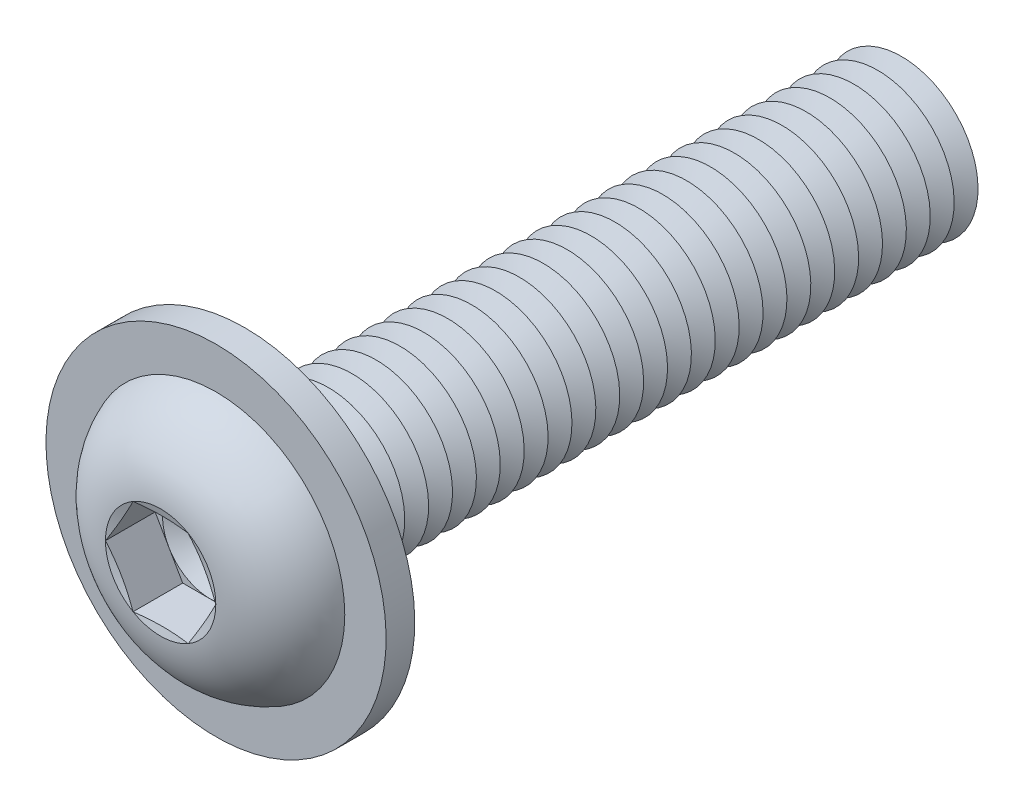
ISO-10303-21;
HEADER;
FILE_DESCRIPTION(('STEP AP214'),'2;1');
FILE_NAME('part.step','',(''),(''),'','','');
FILE_SCHEMA(('AUTOMOTIVE_DESIGN { 1 0 10303 214 1 1 1 1 }'));
ENDSEC;
DATA;
#1=APPLICATION_CONTEXT('core data for automotive mechanical design processes');
#2=APPLICATION_PROTOCOL_DEFINITION('international standard','automotive_design',2000,#1);
#3=PRODUCT_CONTEXT('',#1,'mechanical');
#4=PRODUCT('Part','Part','',(#3));
#5=PRODUCT_RELATED_PRODUCT_CATEGORY('part','',(#4));
#6=PRODUCT_DEFINITION_FORMATION('','',#4);
#7=PRODUCT_DEFINITION_CONTEXT('part definition',#1,'design');
#8=PRODUCT_DEFINITION('design','',#6,#7);
#9=PRODUCT_DEFINITION_SHAPE('','',#8);
#10=(LENGTH_UNIT() NAMED_UNIT(*) SI_UNIT(.MILLI.,.METRE.));
#11=(NAMED_UNIT(*) PLANE_ANGLE_UNIT() SI_UNIT($,.RADIAN.));
#12=(NAMED_UNIT(*) SI_UNIT($,.STERADIAN.) SOLID_ANGLE_UNIT());
#13=UNCERTAINTY_MEASURE_WITH_UNIT(LENGTH_MEASURE(1.E-05),#10,'distance_accuracy_value','');
#14=(GEOMETRIC_REPRESENTATION_CONTEXT(3) GLOBAL_UNCERTAINTY_ASSIGNED_CONTEXT((#13)) GLOBAL_UNIT_ASSIGNED_CONTEXT((#10,
#11,#12)) REPRESENTATION_CONTEXT('',''));
#15=CARTESIAN_POINT('',(0.,0.,0.));
#16=DIRECTION('',(0.,0.,1.));
#17=DIRECTION('',(1.,0.,0.));
#18=AXIS2_PLACEMENT_3D('',#15,#16,#17);
#19=CARTESIAN_POINT('',(0.,0.,-30.625));
#20=DIRECTION('',(0.,0.,1.));
#21=DIRECTION('',(0.,-1.,0.));
#22=AXIS2_PLACEMENT_3D('',#19,#20,#21);
#23=CONICAL_SURFACE('',#22,3.99999999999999,1.0471975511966);
#24=CARTESIAN_POINT('',(0.,0.,-31.25));
#25=DIRECTION('',(0.,0.,1.));
#26=DIRECTION('',(0.,-1.,0.));
#27=AXIS2_PLACEMENT_3D('',#24,#25,#26);
#28=CIRCLE('',#27,2.91746824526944);
#29=CARTESIAN_POINT('',(0.,-2.91746824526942,-31.25));
#30=VERTEX_POINT('',#29);
#31=EDGE_CURVE('E433',#30,#30,#28,.T.);
#32=ORIENTED_EDGE('',*,*,#31,.T.);
#33=EDGE_LOOP('',(#32));
#34=FACE_BOUND('',#33,.T.);
#35=CARTESIAN_POINT('',(0.,0.,-30.625));
#36=DIRECTION('',(0.,0.,1.));
#37=DIRECTION('',(0.,-1.,0.));
#38=AXIS2_PLACEMENT_3D('',#35,#36,#37);
#39=CIRCLE('',#38,3.99999999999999);
#40=CARTESIAN_POINT('',(0.,-3.99999999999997,-30.625));
#41=VERTEX_POINT('',#40);
#42=EDGE_CURVE('E429',#41,#41,#39,.T.);
#43=ORIENTED_EDGE('',*,*,#42,.F.);
#44=EDGE_LOOP('',(#43));
#45=FACE_BOUND('',#44,.T.);
#46=ADVANCED_FACE('F39',(#34,#45),#23,.T.);
#47=CARTESIAN_POINT('',(0.,0.,-31.25));
#48=DIRECTION('',(0.,0.,-1.));
#49=DIRECTION('',(0.,1.,0.));
#50=AXIS2_PLACEMENT_3D('',#47,#48,#49);
#51=CONICAL_SURFACE('',#50,2.91746824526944,1.0471975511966);
#52=CARTESIAN_POINT('',(0.,0.,-31.875));
#53=DIRECTION('',(0.,0.,1.));
#54=DIRECTION('',(0.,-1.,0.));
#55=AXIS2_PLACEMENT_3D('',#52,#53,#54);
#56=CIRCLE('',#55,3.99999999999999);
#57=CARTESIAN_POINT('',(0.,-3.99999999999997,-31.875));
#58=VERTEX_POINT('',#57);
#59=EDGE_CURVE('E437',#58,#58,#56,.T.);
#60=ORIENTED_EDGE('',*,*,#59,.T.);
#61=EDGE_LOOP('',(#60));
#62=FACE_BOUND('',#61,.T.);
#63=ORIENTED_EDGE('',*,*,#31,.F.);
#64=EDGE_LOOP('',(#63));
#65=FACE_BOUND('',#64,.T.);
#66=ADVANCED_FACE('F553',(#62,#65),#51,.T.);
#67=CARTESIAN_POINT('',(0.,4.,-35.));
#68=DIRECTION('',(0.,0.,-1.));
#69=DIRECTION('',(0.,1.,0.));
#70=AXIS2_PLACEMENT_3D('',#67,#68,#69);
#71=PLANE('',#70);
#72=CARTESIAN_POINT('',(0.,0.,-35.));
#73=DIRECTION('',(0.,0.,1.));
#74=DIRECTION('',(0.,-1.,0.));
#75=AXIS2_PLACEMENT_3D('',#72,#73,#74);
#76=CIRCLE('',#75,2.91746824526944);
#77=CARTESIAN_POINT('',(0.,-2.91746824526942,-35.));
#78=VERTEX_POINT('',#77);
#79=EDGE_CURVE('E457',#78,#78,#76,.T.);
#80=ORIENTED_EDGE('',*,*,#79,.F.);
#81=EDGE_LOOP('',(#80));
#82=FACE_BOUND('',#81,.T.);
#83=ADVANCED_FACE('F559',(#82),#71,.T.);
#84=CARTESIAN_POINT('',(0.,0.,-34.375));
#85=DIRECTION('',(0.,0.,1.));
#86=DIRECTION('',(0.,-1.,0.));
#87=AXIS2_PLACEMENT_3D('',#84,#85,#86);
#88=CONICAL_SURFACE('',#87,3.99999999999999,1.0471975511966);
#89=ORIENTED_EDGE('',*,*,#79,.T.);
#90=EDGE_LOOP('',(#89));
#91=FACE_BOUND('',#90,.T.);
#92=CARTESIAN_POINT('',(0.,0.,-34.375));
#93=DIRECTION('',(0.,0.,1.));
#94=DIRECTION('',(0.,-1.,0.));
#95=AXIS2_PLACEMENT_3D('',#92,#93,#94);
#96=CIRCLE('',#95,3.99999999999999);
#97=CARTESIAN_POINT('',(0.,-3.99999999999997,-34.375));
#98=VERTEX_POINT('',#97);
#99=EDGE_CURVE('E453',#98,#98,#96,.T.);
#100=ORIENTED_EDGE('',*,*,#99,.F.);
#101=EDGE_LOOP('',(#100));
#102=FACE_BOUND('',#101,.T.);
#103=ADVANCED_FACE('F578',(#91,#102),#88,.T.);
#104=CARTESIAN_POINT('',(0.,0.,-33.75));
#105=DIRECTION('',(0.,0.,-1.));
#106=DIRECTION('',(0.,1.,0.));
#107=AXIS2_PLACEMENT_3D('',#104,#105,#106);
#108=CONICAL_SURFACE('',#107,2.91746824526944,1.0471975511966);
#109=ORIENTED_EDGE('',*,*,#99,.T.);
#110=EDGE_LOOP('',(#109));
#111=FACE_BOUND('',#110,.T.);
#112=CARTESIAN_POINT('',(0.,0.,-33.75));
#113=DIRECTION('',(0.,0.,1.));
#114=DIRECTION('',(0.,-1.,0.));
#115=AXIS2_PLACEMENT_3D('',#112,#113,#114);
#116=CIRCLE('',#115,2.91746824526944);
#117=CARTESIAN_POINT('',(0.,-2.91746824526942,-33.75));
#118=VERTEX_POINT('',#117);
#119=EDGE_CURVE('E449',#118,#118,#116,.T.);
#120=ORIENTED_EDGE('',*,*,#119,.F.);
#121=EDGE_LOOP('',(#120));
#122=FACE_BOUND('',#121,.T.);
#123=ADVANCED_FACE('F575',(#111,#122),#108,.T.);
#124=CARTESIAN_POINT('',(0.,0.,-33.125));
#125=DIRECTION('',(0.,0.,1.));
#126=DIRECTION('',(0.,-1.,0.));
#127=AXIS2_PLACEMENT_3D('',#124,#125,#126);
#128=CONICAL_SURFACE('',#127,3.99999999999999,1.0471975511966);
#129=ORIENTED_EDGE('',*,*,#119,.T.);
#130=EDGE_LOOP('',(#129));
#131=FACE_BOUND('',#130,.T.);
#132=CARTESIAN_POINT('',(0.,0.,-33.125));
#133=DIRECTION('',(0.,0.,1.));
#134=DIRECTION('',(0.,-1.,0.));
#135=AXIS2_PLACEMENT_3D('',#132,#133,#134);
#136=CIRCLE('',#135,3.99999999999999);
#137=CARTESIAN_POINT('',(0.,-3.99999999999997,-33.125));
#138=VERTEX_POINT('',#137);
#139=EDGE_CURVE('E445',#138,#138,#136,.T.);
#140=ORIENTED_EDGE('',*,*,#139,.F.);
#141=EDGE_LOOP('',(#140));
#142=FACE_BOUND('',#141,.T.);
#143=ADVANCED_FACE('F569',(#131,#142),#128,.T.);
#144=CARTESIAN_POINT('',(0.,0.,-32.5));
#145=DIRECTION('',(0.,0.,-1.));
#146=DIRECTION('',(0.,1.,0.));
#147=AXIS2_PLACEMENT_3D('',#144,#145,#146);
#148=CONICAL_SURFACE('',#147,2.91746824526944,1.0471975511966);
#149=ORIENTED_EDGE('',*,*,#139,.T.);
#150=EDGE_LOOP('',(#149));
#151=FACE_BOUND('',#150,.T.);
#152=CARTESIAN_POINT('',(0.,0.,-32.5));
#153=DIRECTION('',(0.,0.,1.));
#154=DIRECTION('',(0.,-1.,0.));
#155=AXIS2_PLACEMENT_3D('',#152,#153,#154);
#156=CIRCLE('',#155,2.91746824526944);
#157=CARTESIAN_POINT('',(0.,-2.91746824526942,-32.5));
#158=VERTEX_POINT('',#157);
#159=EDGE_CURVE('E441',#158,#158,#156,.T.);
#160=ORIENTED_EDGE('',*,*,#159,.F.);
#161=EDGE_LOOP('',(#160));
#162=FACE_BOUND('',#161,.T.);
#163=ADVANCED_FACE('F565',(#151,#162),#148,.T.);
#164=CARTESIAN_POINT('',(0.,0.,-31.875));
#165=DIRECTION('',(0.,0.,1.));
#166=DIRECTION('',(0.,-1.,0.));
#167=AXIS2_PLACEMENT_3D('',#164,#165,#166);
#168=CONICAL_SURFACE('',#167,3.99999999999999,1.0471975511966);
#169=ORIENTED_EDGE('',*,*,#159,.T.);
#170=EDGE_LOOP('',(#169));
#171=FACE_BOUND('',#170,.T.);
#172=ORIENTED_EDGE('',*,*,#59,.F.);
#173=EDGE_LOOP('',(#172));
#174=FACE_BOUND('',#173,.T.);
#175=ADVANCED_FACE('F568',(#171,#174),#168,.T.);
#176=CARTESIAN_POINT('',(0.,0.,-29.375));
#177=DIRECTION('',(0.,0.,1.));
#178=DIRECTION('',(0.,-1.,0.));
#179=AXIS2_PLACEMENT_3D('',#176,#177,#178);
#180=CONICAL_SURFACE('',#179,3.99999999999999,1.0471975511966);
#181=CARTESIAN_POINT('',(0.,0.,-30.));
#182=DIRECTION('',(0.,0.,1.));
#183=DIRECTION('',(0.,-1.,0.));
#184=AXIS2_PLACEMENT_3D('',#181,#182,#183);
#185=CIRCLE('',#184,2.91746824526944);
#186=CARTESIAN_POINT('',(0.,-2.91746824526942,-30.));
#187=VERTEX_POINT('',#186);
#188=EDGE_CURVE('E425',#187,#187,#185,.T.);
#189=ORIENTED_EDGE('',*,*,#188,.T.);
#190=EDGE_LOOP('',(#189));
#191=FACE_BOUND('',#190,.T.);
#192=CARTESIAN_POINT('',(0.,0.,-29.375));
#193=DIRECTION('',(0.,0.,1.));
#194=DIRECTION('',(0.,-1.,0.));
#195=AXIS2_PLACEMENT_3D('',#192,#193,#194);
#196=CIRCLE('',#195,3.99999999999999);
#197=CARTESIAN_POINT('',(0.,-3.99999999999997,-29.375));
#198=VERTEX_POINT('',#197);
#199=EDGE_CURVE('E421',#198,#198,#196,.T.);
#200=ORIENTED_EDGE('',*,*,#199,.F.);
#201=EDGE_LOOP('',(#200));
#202=FACE_BOUND('',#201,.T.);
#203=ADVANCED_FACE('F573',(#191,#202),#180,.T.);
#204=CARTESIAN_POINT('',(0.,0.,-30.));
#205=DIRECTION('',(0.,0.,-1.));
#206=DIRECTION('',(0.,1.,0.));
#207=AXIS2_PLACEMENT_3D('',#204,#205,#206);
#208=CONICAL_SURFACE('',#207,2.91746824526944,1.0471975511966);
#209=ORIENTED_EDGE('',*,*,#42,.T.);
#210=EDGE_LOOP('',(#209));
#211=FACE_BOUND('',#210,.T.);
#212=ORIENTED_EDGE('',*,*,#188,.F.);
#213=EDGE_LOOP('',(#212));
#214=FACE_BOUND('',#213,.T.);
#215=ADVANCED_FACE('F624',(#211,#214),#208,.T.);
#216=CARTESIAN_POINT('',(0.,0.,-28.125));
#217=DIRECTION('',(0.,0.,1.));
#218=DIRECTION('',(0.,-1.,0.));
#219=AXIS2_PLACEMENT_3D('',#216,#217,#218);
#220=CONICAL_SURFACE('',#219,3.99999999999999,1.0471975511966);
#221=CARTESIAN_POINT('',(0.,0.,-28.75));
#222=DIRECTION('',(0.,0.,1.));
#223=DIRECTION('',(0.,-1.,0.));
#224=AXIS2_PLACEMENT_3D('',#221,#222,#223);
#225=CIRCLE('',#224,2.91746824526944);
#226=CARTESIAN_POINT('',(0.,-2.91746824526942,-28.75));
#227=VERTEX_POINT('',#226);
#228=EDGE_CURVE('E417',#227,#227,#225,.T.);
#229=ORIENTED_EDGE('',*,*,#228,.T.);
#230=EDGE_LOOP('',(#229));
#231=FACE_BOUND('',#230,.T.);
#232=CARTESIAN_POINT('',(0.,0.,-28.125));
#233=DIRECTION('',(0.,0.,1.));
#234=DIRECTION('',(0.,-1.,0.));
#235=AXIS2_PLACEMENT_3D('',#232,#233,#234);
#236=CIRCLE('',#235,3.99999999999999);
#237=CARTESIAN_POINT('',(0.,-3.99999999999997,-28.125));
#238=VERTEX_POINT('',#237);
#239=EDGE_CURVE('E413',#238,#238,#236,.T.);
#240=ORIENTED_EDGE('',*,*,#239,.F.);
#241=EDGE_LOOP('',(#240));
#242=FACE_BOUND('',#241,.T.);
#243=ADVANCED_FACE('F630',(#231,#242),#220,.T.);
#244=CARTESIAN_POINT('',(0.,0.,-28.75));
#245=DIRECTION('',(0.,0.,-1.));
#246=DIRECTION('',(0.,1.,0.));
#247=AXIS2_PLACEMENT_3D('',#244,#245,#246);
#248=CONICAL_SURFACE('',#247,2.91746824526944,1.0471975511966);
#249=ORIENTED_EDGE('',*,*,#199,.T.);
#250=EDGE_LOOP('',(#249));
#251=FACE_BOUND('',#250,.T.);
#252=ORIENTED_EDGE('',*,*,#228,.F.);
#253=EDGE_LOOP('',(#252));
#254=FACE_BOUND('',#253,.T.);
#255=ADVANCED_FACE('F637',(#251,#254),#248,.T.);
#256=CARTESIAN_POINT('',(0.,0.,-26.875));
#257=DIRECTION('',(0.,0.,1.));
#258=DIRECTION('',(0.,-1.,0.));
#259=AXIS2_PLACEMENT_3D('',#256,#257,#258);
#260=CONICAL_SURFACE('',#259,3.99999999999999,1.0471975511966);
#261=CARTESIAN_POINT('',(0.,0.,-27.5));
#262=DIRECTION('',(0.,0.,1.));
#263=DIRECTION('',(0.,-1.,0.));
#264=AXIS2_PLACEMENT_3D('',#261,#262,#263);
#265=CIRCLE('',#264,2.91746824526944);
#266=CARTESIAN_POINT('',(0.,-2.91746824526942,-27.5));
#267=VERTEX_POINT('',#266);
#268=EDGE_CURVE('E410',#267,#267,#265,.T.);
#269=ORIENTED_EDGE('',*,*,#268,.T.);
#270=EDGE_LOOP('',(#269));
#271=FACE_BOUND('',#270,.T.);
#272=CARTESIAN_POINT('',(0.,0.,-26.875));
#273=DIRECTION('',(0.,0.,1.));
#274=DIRECTION('',(0.,-1.,0.));
#275=AXIS2_PLACEMENT_3D('',#272,#273,#274);
#276=CIRCLE('',#275,3.99999999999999);
#277=CARTESIAN_POINT('',(0.,-3.99999999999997,-26.875));
#278=VERTEX_POINT('',#277);
#279=EDGE_CURVE('E406',#278,#278,#276,.T.);
#280=ORIENTED_EDGE('',*,*,#279,.F.);
#281=EDGE_LOOP('',(#280));
#282=FACE_BOUND('',#281,.T.);
#283=ADVANCED_FACE('F644',(#271,#282),#260,.T.);
#284=CARTESIAN_POINT('',(0.,0.,-27.5));
#285=DIRECTION('',(0.,0.,-1.));
#286=DIRECTION('',(0.,1.,0.));
#287=AXIS2_PLACEMENT_3D('',#284,#285,#286);
#288=CONICAL_SURFACE('',#287,2.91746824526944,1.0471975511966);
#289=ORIENTED_EDGE('',*,*,#239,.T.);
#290=EDGE_LOOP('',(#289));
#291=FACE_BOUND('',#290,.T.);
#292=ORIENTED_EDGE('',*,*,#268,.F.);
#293=EDGE_LOOP('',(#292));
#294=FACE_BOUND('',#293,.T.);
#295=ADVANCED_FACE('F651',(#291,#294),#288,.T.);
#296=CARTESIAN_POINT('',(0.,0.,-25.625));
#297=DIRECTION('',(0.,0.,1.));
#298=DIRECTION('',(0.,-1.,0.));
#299=AXIS2_PLACEMENT_3D('',#296,#297,#298);
#300=CONICAL_SURFACE('',#299,3.99999999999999,1.0471975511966);
#301=CARTESIAN_POINT('',(0.,0.,-26.25));
#302=DIRECTION('',(0.,0.,1.));
#303=DIRECTION('',(0.,-1.,0.));
#304=AXIS2_PLACEMENT_3D('',#301,#302,#303);
#305=CIRCLE('',#304,2.91746824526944);
#306=CARTESIAN_POINT('',(0.,-2.91746824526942,-26.25));
#307=VERTEX_POINT('',#306);
#308=EDGE_CURVE('E402',#307,#307,#305,.T.);
#309=ORIENTED_EDGE('',*,*,#308,.T.);
#310=EDGE_LOOP('',(#309));
#311=FACE_BOUND('',#310,.T.);
#312=CARTESIAN_POINT('',(0.,0.,-25.625));
#313=DIRECTION('',(0.,0.,1.));
#314=DIRECTION('',(0.,-1.,0.));
#315=AXIS2_PLACEMENT_3D('',#312,#313,#314);
#316=CIRCLE('',#315,3.99999999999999);
#317=CARTESIAN_POINT('',(0.,-3.99999999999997,-25.625));
#318=VERTEX_POINT('',#317);
#319=EDGE_CURVE('E398',#318,#318,#316,.T.);
#320=ORIENTED_EDGE('',*,*,#319,.F.);
#321=EDGE_LOOP('',(#320));
#322=FACE_BOUND('',#321,.T.);
#323=ADVANCED_FACE('F658',(#311,#322),#300,.T.);
#324=CARTESIAN_POINT('',(0.,0.,-26.25));
#325=DIRECTION('',(0.,0.,-1.));
#326=DIRECTION('',(0.,1.,0.));
#327=AXIS2_PLACEMENT_3D('',#324,#325,#326);
#328=CONICAL_SURFACE('',#327,2.91746824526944,1.0471975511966);
#329=ORIENTED_EDGE('',*,*,#279,.T.);
#330=EDGE_LOOP('',(#329));
#331=FACE_BOUND('',#330,.T.);
#332=ORIENTED_EDGE('',*,*,#308,.F.);
#333=EDGE_LOOP('',(#332));
#334=FACE_BOUND('',#333,.T.);
#335=ADVANCED_FACE('F665',(#331,#334),#328,.T.);
#336=CARTESIAN_POINT('',(0.,0.,-24.375));
#337=DIRECTION('',(0.,0.,1.));
#338=DIRECTION('',(0.,-1.,0.));
#339=AXIS2_PLACEMENT_3D('',#336,#337,#338);
#340=CONICAL_SURFACE('',#339,3.99999999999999,1.0471975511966);
#341=CARTESIAN_POINT('',(0.,0.,-25.));
#342=DIRECTION('',(0.,0.,1.));
#343=DIRECTION('',(0.,-1.,0.));
#344=AXIS2_PLACEMENT_3D('',#341,#342,#343);
#345=CIRCLE('',#344,2.91746824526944);
#346=CARTESIAN_POINT('',(0.,-2.91746824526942,-25.));
#347=VERTEX_POINT('',#346);
#348=EDGE_CURVE('E394',#347,#347,#345,.T.);
#349=ORIENTED_EDGE('',*,*,#348,.T.);
#350=EDGE_LOOP('',(#349));
#351=FACE_BOUND('',#350,.T.);
#352=CARTESIAN_POINT('',(0.,0.,-24.375));
#353=DIRECTION('',(0.,0.,1.));
#354=DIRECTION('',(0.,-1.,0.));
#355=AXIS2_PLACEMENT_3D('',#352,#353,#354);
#356=CIRCLE('',#355,3.99999999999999);
#357=CARTESIAN_POINT('',(0.,-3.99999999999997,-24.375));
#358=VERTEX_POINT('',#357);
#359=EDGE_CURVE('E390',#358,#358,#356,.T.);
#360=ORIENTED_EDGE('',*,*,#359,.F.);
#361=EDGE_LOOP('',(#360));
#362=FACE_BOUND('',#361,.T.);
#363=ADVANCED_FACE('F672',(#351,#362),#340,.T.);
#364=CARTESIAN_POINT('',(0.,0.,-25.));
#365=DIRECTION('',(0.,0.,-1.));
#366=DIRECTION('',(0.,1.,0.));
#367=AXIS2_PLACEMENT_3D('',#364,#365,#366);
#368=CONICAL_SURFACE('',#367,2.91746824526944,1.0471975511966);
#369=ORIENTED_EDGE('',*,*,#319,.T.);
#370=EDGE_LOOP('',(#369));
#371=FACE_BOUND('',#370,.T.);
#372=ORIENTED_EDGE('',*,*,#348,.F.);
#373=EDGE_LOOP('',(#372));
#374=FACE_BOUND('',#373,.T.);
#375=ADVANCED_FACE('F679',(#371,#374),#368,.T.);
#376=CARTESIAN_POINT('',(0.,0.,-23.125));
#377=DIRECTION('',(0.,0.,1.));
#378=DIRECTION('',(0.,-1.,0.));
#379=AXIS2_PLACEMENT_3D('',#376,#377,#378);
#380=CONICAL_SURFACE('',#379,3.99999999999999,1.0471975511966);
#381=CARTESIAN_POINT('',(0.,0.,-23.75));
#382=DIRECTION('',(0.,0.,1.));
#383=DIRECTION('',(0.,-1.,0.));
#384=AXIS2_PLACEMENT_3D('',#381,#382,#383);
#385=CIRCLE('',#384,2.91746824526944);
#386=CARTESIAN_POINT('',(0.,-2.91746824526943,-23.75));
#387=VERTEX_POINT('',#386);
#388=EDGE_CURVE('E386',#387,#387,#385,.T.);
#389=ORIENTED_EDGE('',*,*,#388,.T.);
#390=EDGE_LOOP('',(#389));
#391=FACE_BOUND('',#390,.T.);
#392=CARTESIAN_POINT('',(0.,0.,-23.125));
#393=DIRECTION('',(0.,0.,1.));
#394=DIRECTION('',(0.,-1.,0.));
#395=AXIS2_PLACEMENT_3D('',#392,#393,#394);
#396=CIRCLE('',#395,3.99999999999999);
#397=CARTESIAN_POINT('',(0.,-3.99999999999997,-23.125));
#398=VERTEX_POINT('',#397);
#399=EDGE_CURVE('E382',#398,#398,#396,.T.);
#400=ORIENTED_EDGE('',*,*,#399,.F.);
#401=EDGE_LOOP('',(#400));
#402=FACE_BOUND('',#401,.T.);
#403=ADVANCED_FACE('F686',(#391,#402),#380,.T.);
#404=CARTESIAN_POINT('',(0.,0.,-23.75));
#405=DIRECTION('',(0.,0.,-1.));
#406=DIRECTION('',(0.,1.,0.));
#407=AXIS2_PLACEMENT_3D('',#404,#405,#406);
#408=CONICAL_SURFACE('',#407,2.91746824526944,1.0471975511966);
#409=ORIENTED_EDGE('',*,*,#359,.T.);
#410=EDGE_LOOP('',(#409));
#411=FACE_BOUND('',#410,.T.);
#412=ORIENTED_EDGE('',*,*,#388,.F.);
#413=EDGE_LOOP('',(#412));
#414=FACE_BOUND('',#413,.T.);
#415=ADVANCED_FACE('F693',(#411,#414),#408,.T.);
#416=CARTESIAN_POINT('',(0.,0.,-21.875));
#417=DIRECTION('',(0.,0.,1.));
#418=DIRECTION('',(0.,-1.,0.));
#419=AXIS2_PLACEMENT_3D('',#416,#417,#418);
#420=CONICAL_SURFACE('',#419,3.99999999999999,1.0471975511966);
#421=CARTESIAN_POINT('',(0.,0.,-22.5));
#422=DIRECTION('',(0.,0.,1.));
#423=DIRECTION('',(0.,-1.,0.));
#424=AXIS2_PLACEMENT_3D('',#421,#422,#423);
#425=CIRCLE('',#424,2.91746824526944);
#426=CARTESIAN_POINT('',(0.,-2.91746824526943,-22.5));
#427=VERTEX_POINT('',#426);
#428=EDGE_CURVE('E378',#427,#427,#425,.T.);
#429=ORIENTED_EDGE('',*,*,#428,.T.);
#430=EDGE_LOOP('',(#429));
#431=FACE_BOUND('',#430,.T.);
#432=CARTESIAN_POINT('',(0.,0.,-21.875));
#433=DIRECTION('',(0.,0.,1.));
#434=DIRECTION('',(0.,-1.,0.));
#435=AXIS2_PLACEMENT_3D('',#432,#433,#434);
#436=CIRCLE('',#435,3.99999999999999);
#437=CARTESIAN_POINT('',(0.,-3.99999999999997,-21.875));
#438=VERTEX_POINT('',#437);
#439=EDGE_CURVE('E374',#438,#438,#436,.T.);
#440=ORIENTED_EDGE('',*,*,#439,.F.);
#441=EDGE_LOOP('',(#440));
#442=FACE_BOUND('',#441,.T.);
#443=ADVANCED_FACE('F700',(#431,#442),#420,.T.);
#444=CARTESIAN_POINT('',(0.,0.,-22.5));
#445=DIRECTION('',(0.,0.,-1.));
#446=DIRECTION('',(0.,1.,0.));
#447=AXIS2_PLACEMENT_3D('',#444,#445,#446);
#448=CONICAL_SURFACE('',#447,2.91746824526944,1.0471975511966);
#449=ORIENTED_EDGE('',*,*,#399,.T.);
#450=EDGE_LOOP('',(#449));
#451=FACE_BOUND('',#450,.T.);
#452=ORIENTED_EDGE('',*,*,#428,.F.);
#453=EDGE_LOOP('',(#452));
#454=FACE_BOUND('',#453,.T.);
#455=ADVANCED_FACE('F707',(#451,#454),#448,.T.);
#456=CARTESIAN_POINT('',(0.,0.,-20.625));
#457=DIRECTION('',(0.,0.,1.));
#458=DIRECTION('',(0.,-1.,0.));
#459=AXIS2_PLACEMENT_3D('',#456,#457,#458);
#460=CONICAL_SURFACE('',#459,3.99999999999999,1.0471975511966);
#461=CARTESIAN_POINT('',(0.,0.,-21.25));
#462=DIRECTION('',(0.,0.,1.));
#463=DIRECTION('',(0.,-1.,0.));
#464=AXIS2_PLACEMENT_3D('',#461,#462,#463);
#465=CIRCLE('',#464,2.91746824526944);
#466=CARTESIAN_POINT('',(0.,-2.91746824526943,-21.25));
#467=VERTEX_POINT('',#466);
#468=EDGE_CURVE('E370',#467,#467,#465,.T.);
#469=ORIENTED_EDGE('',*,*,#468,.T.);
#470=EDGE_LOOP('',(#469));
#471=FACE_BOUND('',#470,.T.);
#472=CARTESIAN_POINT('',(0.,0.,-20.625));
#473=DIRECTION('',(0.,0.,1.));
#474=DIRECTION('',(0.,-1.,0.));
#475=AXIS2_PLACEMENT_3D('',#472,#473,#474);
#476=CIRCLE('',#475,3.99999999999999);
#477=CARTESIAN_POINT('',(0.,-3.99999999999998,-20.625));
#478=VERTEX_POINT('',#477);
#479=EDGE_CURVE('E366',#478,#478,#476,.T.);
#480=ORIENTED_EDGE('',*,*,#479,.F.);
#481=EDGE_LOOP('',(#480));
#482=FACE_BOUND('',#481,.T.);
#483=ADVANCED_FACE('F714',(#471,#482),#460,.T.);
#484=CARTESIAN_POINT('',(0.,0.,-21.25));
#485=DIRECTION('',(0.,0.,-1.));
#486=DIRECTION('',(0.,1.,0.));
#487=AXIS2_PLACEMENT_3D('',#484,#485,#486);
#488=CONICAL_SURFACE('',#487,2.91746824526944,1.0471975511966);
#489=ORIENTED_EDGE('',*,*,#439,.T.);
#490=EDGE_LOOP('',(#489));
#491=FACE_BOUND('',#490,.T.);
#492=ORIENTED_EDGE('',*,*,#468,.F.);
#493=EDGE_LOOP('',(#492));
#494=FACE_BOUND('',#493,.T.);
#495=ADVANCED_FACE('F721',(#491,#494),#488,.T.);
#496=CARTESIAN_POINT('',(0.,0.,-19.375));
#497=DIRECTION('',(0.,0.,1.));
#498=DIRECTION('',(0.,-1.,0.));
#499=AXIS2_PLACEMENT_3D('',#496,#497,#498);
#500=CONICAL_SURFACE('',#499,3.99999999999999,1.0471975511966);
#501=CARTESIAN_POINT('',(0.,0.,-20.));
#502=DIRECTION('',(0.,0.,1.));
#503=DIRECTION('',(0.,-1.,0.));
#504=AXIS2_PLACEMENT_3D('',#501,#502,#503);
#505=CIRCLE('',#504,2.91746824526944);
#506=CARTESIAN_POINT('',(0.,-2.91746824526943,-20.));
#507=VERTEX_POINT('',#506);
#508=EDGE_CURVE('E362',#507,#507,#505,.T.);
#509=ORIENTED_EDGE('',*,*,#508,.T.);
#510=EDGE_LOOP('',(#509));
#511=FACE_BOUND('',#510,.T.);
#512=CARTESIAN_POINT('',(0.,0.,-19.375));
#513=DIRECTION('',(0.,0.,1.));
#514=DIRECTION('',(0.,-1.,0.));
#515=AXIS2_PLACEMENT_3D('',#512,#513,#514);
#516=CIRCLE('',#515,3.99999999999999);
#517=CARTESIAN_POINT('',(0.,-3.99999999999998,-19.375));
#518=VERTEX_POINT('',#517);
#519=EDGE_CURVE('E358',#518,#518,#516,.T.);
#520=ORIENTED_EDGE('',*,*,#519,.F.);
#521=EDGE_LOOP('',(#520));
#522=FACE_BOUND('',#521,.T.);
#523=ADVANCED_FACE('F728',(#511,#522),#500,.T.);
#524=CARTESIAN_POINT('',(0.,0.,-20.));
#525=DIRECTION('',(0.,0.,-1.));
#526=DIRECTION('',(0.,1.,0.));
#527=AXIS2_PLACEMENT_3D('',#524,#525,#526);
#528=CONICAL_SURFACE('',#527,2.91746824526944,1.0471975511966);
#529=ORIENTED_EDGE('',*,*,#479,.T.);
#530=EDGE_LOOP('',(#529));
#531=FACE_BOUND('',#530,.T.);
#532=ORIENTED_EDGE('',*,*,#508,.F.);
#533=EDGE_LOOP('',(#532));
#534=FACE_BOUND('',#533,.T.);
#535=ADVANCED_FACE('F735',(#531,#534),#528,.T.);
#536=CARTESIAN_POINT('',(0.,0.,-18.125));
#537=DIRECTION('',(0.,0.,1.));
#538=DIRECTION('',(0.,-1.,0.));
#539=AXIS2_PLACEMENT_3D('',#536,#537,#538);
#540=CONICAL_SURFACE('',#539,3.99999999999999,1.0471975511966);
#541=CARTESIAN_POINT('',(0.,0.,-18.75));
#542=DIRECTION('',(0.,0.,1.));
#543=DIRECTION('',(0.,-1.,0.));
#544=AXIS2_PLACEMENT_3D('',#541,#542,#543);
#545=CIRCLE('',#544,2.91746824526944);
#546=CARTESIAN_POINT('',(0.,-2.91746824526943,-18.75));
#547=VERTEX_POINT('',#546);
#548=EDGE_CURVE('E354',#547,#547,#545,.T.);
#549=ORIENTED_EDGE('',*,*,#548,.T.);
#550=EDGE_LOOP('',(#549));
#551=FACE_BOUND('',#550,.T.);
#552=CARTESIAN_POINT('',(0.,0.,-18.125));
#553=DIRECTION('',(0.,0.,1.));
#554=DIRECTION('',(0.,-1.,0.));
#555=AXIS2_PLACEMENT_3D('',#552,#553,#554);
#556=CIRCLE('',#555,3.99999999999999);
#557=CARTESIAN_POINT('',(0.,-3.99999999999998,-18.125));
#558=VERTEX_POINT('',#557);
#559=EDGE_CURVE('E350',#558,#558,#556,.T.);
#560=ORIENTED_EDGE('',*,*,#559,.F.);
#561=EDGE_LOOP('',(#560));
#562=FACE_BOUND('',#561,.T.);
#563=ADVANCED_FACE('F742',(#551,#562),#540,.T.);
#564=CARTESIAN_POINT('',(0.,0.,-18.75));
#565=DIRECTION('',(0.,0.,-1.));
#566=DIRECTION('',(0.,1.,0.));
#567=AXIS2_PLACEMENT_3D('',#564,#565,#566);
#568=CONICAL_SURFACE('',#567,2.91746824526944,1.0471975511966);
#569=ORIENTED_EDGE('',*,*,#519,.T.);
#570=EDGE_LOOP('',(#569));
#571=FACE_BOUND('',#570,.T.);
#572=ORIENTED_EDGE('',*,*,#548,.F.);
#573=EDGE_LOOP('',(#572));
#574=FACE_BOUND('',#573,.T.);
#575=ADVANCED_FACE('F749',(#571,#574),#568,.T.);
#576=CARTESIAN_POINT('',(0.,0.,-16.875));
#577=DIRECTION('',(0.,0.,1.));
#578=DIRECTION('',(0.,-1.,0.));
#579=AXIS2_PLACEMENT_3D('',#576,#577,#578);
#580=CONICAL_SURFACE('',#579,3.99999999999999,1.0471975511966);
#581=CARTESIAN_POINT('',(0.,0.,-17.5));
#582=DIRECTION('',(0.,0.,1.));
#583=DIRECTION('',(0.,-1.,0.));
#584=AXIS2_PLACEMENT_3D('',#581,#582,#583);
#585=CIRCLE('',#584,2.91746824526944);
#586=CARTESIAN_POINT('',(0.,-2.91746824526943,-17.5));
#587=VERTEX_POINT('',#586);
#588=EDGE_CURVE('E346',#587,#587,#585,.T.);
#589=ORIENTED_EDGE('',*,*,#588,.T.);
#590=EDGE_LOOP('',(#589));
#591=FACE_BOUND('',#590,.T.);
#592=CARTESIAN_POINT('',(0.,0.,-16.875));
#593=DIRECTION('',(0.,0.,1.));
#594=DIRECTION('',(0.,-1.,0.));
#595=AXIS2_PLACEMENT_3D('',#592,#593,#594);
#596=CIRCLE('',#595,3.99999999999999);
#597=CARTESIAN_POINT('',(0.,-3.99999999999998,-16.875));
#598=VERTEX_POINT('',#597);
#599=EDGE_CURVE('E342',#598,#598,#596,.T.);
#600=ORIENTED_EDGE('',*,*,#599,.F.);
#601=EDGE_LOOP('',(#600));
#602=FACE_BOUND('',#601,.T.);
#603=ADVANCED_FACE('F756',(#591,#602),#580,.T.);
#604=CARTESIAN_POINT('',(0.,0.,-17.5));
#605=DIRECTION('',(0.,0.,-1.));
#606=DIRECTION('',(0.,1.,0.));
#607=AXIS2_PLACEMENT_3D('',#604,#605,#606);
#608=CONICAL_SURFACE('',#607,2.91746824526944,1.0471975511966);
#609=ORIENTED_EDGE('',*,*,#559,.T.);
#610=EDGE_LOOP('',(#609));
#611=FACE_BOUND('',#610,.T.);
#612=ORIENTED_EDGE('',*,*,#588,.F.);
#613=EDGE_LOOP('',(#612));
#614=FACE_BOUND('',#613,.T.);
#615=ADVANCED_FACE('F763',(#611,#614),#608,.T.);
#616=CARTESIAN_POINT('',(0.,0.,-15.625));
#617=DIRECTION('',(0.,0.,1.));
#618=DIRECTION('',(0.,-1.,0.));
#619=AXIS2_PLACEMENT_3D('',#616,#617,#618);
#620=CONICAL_SURFACE('',#619,3.99999999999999,1.0471975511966);
#621=CARTESIAN_POINT('',(0.,0.,-16.25));
#622=DIRECTION('',(0.,0.,1.));
#623=DIRECTION('',(0.,-1.,0.));
#624=AXIS2_PLACEMENT_3D('',#621,#622,#623);
#625=CIRCLE('',#624,2.91746824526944);
#626=CARTESIAN_POINT('',(0.,-2.91746824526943,-16.25));
#627=VERTEX_POINT('',#626);
#628=EDGE_CURVE('E338',#627,#627,#625,.T.);
#629=ORIENTED_EDGE('',*,*,#628,.T.);
#630=EDGE_LOOP('',(#629));
#631=FACE_BOUND('',#630,.T.);
#632=CARTESIAN_POINT('',(0.,0.,-15.625));
#633=DIRECTION('',(0.,0.,1.));
#634=DIRECTION('',(0.,-1.,0.));
#635=AXIS2_PLACEMENT_3D('',#632,#633,#634);
#636=CIRCLE('',#635,3.99999999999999);
#637=CARTESIAN_POINT('',(0.,-3.99999999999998,-15.625));
#638=VERTEX_POINT('',#637);
#639=EDGE_CURVE('E334',#638,#638,#636,.T.);
#640=ORIENTED_EDGE('',*,*,#639,.F.);
#641=EDGE_LOOP('',(#640));
#642=FACE_BOUND('',#641,.T.);
#643=ADVANCED_FACE('F770',(#631,#642),#620,.T.);
#644=CARTESIAN_POINT('',(0.,0.,-16.25));
#645=DIRECTION('',(0.,0.,-1.));
#646=DIRECTION('',(0.,1.,0.));
#647=AXIS2_PLACEMENT_3D('',#644,#645,#646);
#648=CONICAL_SURFACE('',#647,2.91746824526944,1.0471975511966);
#649=ORIENTED_EDGE('',*,*,#599,.T.);
#650=EDGE_LOOP('',(#649));
#651=FACE_BOUND('',#650,.T.);
#652=ORIENTED_EDGE('',*,*,#628,.F.);
#653=EDGE_LOOP('',(#652));
#654=FACE_BOUND('',#653,.T.);
#655=ADVANCED_FACE('F777',(#651,#654),#648,.T.);
#656=CARTESIAN_POINT('',(0.,0.,-14.375));
#657=DIRECTION('',(0.,0.,1.));
#658=DIRECTION('',(0.,-1.,0.));
#659=AXIS2_PLACEMENT_3D('',#656,#657,#658);
#660=CONICAL_SURFACE('',#659,3.99999999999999,1.0471975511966);
#661=CARTESIAN_POINT('',(0.,0.,-15.));
#662=DIRECTION('',(0.,0.,1.));
#663=DIRECTION('',(0.,-1.,0.));
#664=AXIS2_PLACEMENT_3D('',#661,#662,#663);
#665=CIRCLE('',#664,2.91746824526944);
#666=CARTESIAN_POINT('',(0.,-2.91746824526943,-15.));
#667=VERTEX_POINT('',#666);
#668=EDGE_CURVE('E330',#667,#667,#665,.T.);
#669=ORIENTED_EDGE('',*,*,#668,.T.);
#670=EDGE_LOOP('',(#669));
#671=FACE_BOUND('',#670,.T.);
#672=CARTESIAN_POINT('',(0.,0.,-14.375));
#673=DIRECTION('',(0.,0.,1.));
#674=DIRECTION('',(0.,-1.,0.));
#675=AXIS2_PLACEMENT_3D('',#672,#673,#674);
#676=CIRCLE('',#675,3.99999999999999);
#677=CARTESIAN_POINT('',(0.,-3.99999999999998,-14.375));
#678=VERTEX_POINT('',#677);
#679=EDGE_CURVE('E326',#678,#678,#676,.T.);
#680=ORIENTED_EDGE('',*,*,#679,.F.);
#681=EDGE_LOOP('',(#680));
#682=FACE_BOUND('',#681,.T.);
#683=ADVANCED_FACE('F784',(#671,#682),#660,.T.);
#684=CARTESIAN_POINT('',(0.,0.,-15.));
#685=DIRECTION('',(0.,0.,-1.));
#686=DIRECTION('',(0.,1.,0.));
#687=AXIS2_PLACEMENT_3D('',#684,#685,#686);
#688=CONICAL_SURFACE('',#687,2.91746824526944,1.0471975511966);
#689=ORIENTED_EDGE('',*,*,#639,.T.);
#690=EDGE_LOOP('',(#689));
#691=FACE_BOUND('',#690,.T.);
#692=ORIENTED_EDGE('',*,*,#668,.F.);
#693=EDGE_LOOP('',(#692));
#694=FACE_BOUND('',#693,.T.);
#695=ADVANCED_FACE('F791',(#691,#694),#688,.T.);
#696=CARTESIAN_POINT('',(0.,0.,-13.125));
#697=DIRECTION('',(0.,0.,1.));
#698=DIRECTION('',(0.,-1.,0.));
#699=AXIS2_PLACEMENT_3D('',#696,#697,#698);
#700=CONICAL_SURFACE('',#699,3.99999999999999,1.0471975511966);
#701=CARTESIAN_POINT('',(0.,0.,-13.75));
#702=DIRECTION('',(0.,0.,1.));
#703=DIRECTION('',(0.,-1.,0.));
#704=AXIS2_PLACEMENT_3D('',#701,#702,#703);
#705=CIRCLE('',#704,2.91746824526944);
#706=CARTESIAN_POINT('',(0.,-2.91746824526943,-13.75));
#707=VERTEX_POINT('',#706);
#708=EDGE_CURVE('E322',#707,#707,#705,.T.);
#709=ORIENTED_EDGE('',*,*,#708,.T.);
#710=EDGE_LOOP('',(#709));
#711=FACE_BOUND('',#710,.T.);
#712=CARTESIAN_POINT('',(0.,0.,-13.125));
#713=DIRECTION('',(0.,0.,1.));
#714=DIRECTION('',(0.,-1.,0.));
#715=AXIS2_PLACEMENT_3D('',#712,#713,#714);
#716=CIRCLE('',#715,3.99999999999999);
#717=CARTESIAN_POINT('',(0.,-3.99999999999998,-13.125));
#718=VERTEX_POINT('',#717);
#719=EDGE_CURVE('E318',#718,#718,#716,.T.);
#720=ORIENTED_EDGE('',*,*,#719,.F.);
#721=EDGE_LOOP('',(#720));
#722=FACE_BOUND('',#721,.T.);
#723=ADVANCED_FACE('F798',(#711,#722),#700,.T.);
#724=CARTESIAN_POINT('',(0.,0.,-13.75));
#725=DIRECTION('',(0.,0.,-1.));
#726=DIRECTION('',(0.,1.,0.));
#727=AXIS2_PLACEMENT_3D('',#724,#725,#726);
#728=CONICAL_SURFACE('',#727,2.91746824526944,1.0471975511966);
#729=ORIENTED_EDGE('',*,*,#679,.T.);
#730=EDGE_LOOP('',(#729));
#731=FACE_BOUND('',#730,.T.);
#732=ORIENTED_EDGE('',*,*,#708,.F.);
#733=EDGE_LOOP('',(#732));
#734=FACE_BOUND('',#733,.T.);
#735=ADVANCED_FACE('F805',(#731,#734),#728,.T.);
#736=CARTESIAN_POINT('',(0.,0.,-11.875));
#737=DIRECTION('',(0.,0.,1.));
#738=DIRECTION('',(0.,-1.,0.));
#739=AXIS2_PLACEMENT_3D('',#736,#737,#738);
#740=CONICAL_SURFACE('',#739,3.99999999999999,1.0471975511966);
#741=CARTESIAN_POINT('',(0.,0.,-12.5));
#742=DIRECTION('',(0.,0.,1.));
#743=DIRECTION('',(0.,-1.,0.));
#744=AXIS2_PLACEMENT_3D('',#741,#742,#743);
#745=CIRCLE('',#744,2.91746824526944);
#746=CARTESIAN_POINT('',(0.,-2.91746824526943,-12.5));
#747=VERTEX_POINT('',#746);
#748=EDGE_CURVE('E314',#747,#747,#745,.T.);
#749=ORIENTED_EDGE('',*,*,#748,.T.);
#750=EDGE_LOOP('',(#749));
#751=FACE_BOUND('',#750,.T.);
#752=CARTESIAN_POINT('',(0.,0.,-11.875));
#753=DIRECTION('',(0.,0.,1.));
#754=DIRECTION('',(0.,-1.,0.));
#755=AXIS2_PLACEMENT_3D('',#752,#753,#754);
#756=CIRCLE('',#755,3.99999999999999);
#757=CARTESIAN_POINT('',(0.,-3.99999999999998,-11.875));
#758=VERTEX_POINT('',#757);
#759=EDGE_CURVE('E310',#758,#758,#756,.T.);
#760=ORIENTED_EDGE('',*,*,#759,.F.);
#761=EDGE_LOOP('',(#760));
#762=FACE_BOUND('',#761,.T.);
#763=ADVANCED_FACE('F812',(#751,#762),#740,.T.);
#764=CARTESIAN_POINT('',(0.,0.,-12.5));
#765=DIRECTION('',(0.,0.,-1.));
#766=DIRECTION('',(0.,1.,0.));
#767=AXIS2_PLACEMENT_3D('',#764,#765,#766);
#768=CONICAL_SURFACE('',#767,2.91746824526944,1.0471975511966);
#769=ORIENTED_EDGE('',*,*,#719,.T.);
#770=EDGE_LOOP('',(#769));
#771=FACE_BOUND('',#770,.T.);
#772=ORIENTED_EDGE('',*,*,#748,.F.);
#773=EDGE_LOOP('',(#772));
#774=FACE_BOUND('',#773,.T.);
#775=ADVANCED_FACE('F819',(#771,#774),#768,.T.);
#776=CARTESIAN_POINT('',(0.,0.,-10.625));
#777=DIRECTION('',(0.,0.,1.));
#778=DIRECTION('',(0.,-1.,0.));
#779=AXIS2_PLACEMENT_3D('',#776,#777,#778);
#780=CONICAL_SURFACE('',#779,3.99999999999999,1.0471975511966);
#781=CARTESIAN_POINT('',(0.,0.,-11.25));
#782=DIRECTION('',(0.,0.,1.));
#783=DIRECTION('',(0.,-1.,0.));
#784=AXIS2_PLACEMENT_3D('',#781,#782,#783);
#785=CIRCLE('',#784,2.91746824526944);
#786=CARTESIAN_POINT('',(0.,-2.91746824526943,-11.25));
#787=VERTEX_POINT('',#786);
#788=EDGE_CURVE('E306',#787,#787,#785,.T.);
#789=ORIENTED_EDGE('',*,*,#788,.T.);
#790=EDGE_LOOP('',(#789));
#791=FACE_BOUND('',#790,.T.);
#792=CARTESIAN_POINT('',(0.,0.,-10.625));
#793=DIRECTION('',(0.,0.,1.));
#794=DIRECTION('',(0.,-1.,0.));
#795=AXIS2_PLACEMENT_3D('',#792,#793,#794);
#796=CIRCLE('',#795,3.99999999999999);
#797=CARTESIAN_POINT('',(0.,-3.99999999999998,-10.625));
#798=VERTEX_POINT('',#797);
#799=EDGE_CURVE('E302',#798,#798,#796,.T.);
#800=ORIENTED_EDGE('',*,*,#799,.F.);
#801=EDGE_LOOP('',(#800));
#802=FACE_BOUND('',#801,.T.);
#803=ADVANCED_FACE('F826',(#791,#802),#780,.T.);
#804=CARTESIAN_POINT('',(0.,0.,-11.25));
#805=DIRECTION('',(0.,0.,-1.));
#806=DIRECTION('',(0.,1.,0.));
#807=AXIS2_PLACEMENT_3D('',#804,#805,#806);
#808=CONICAL_SURFACE('',#807,2.91746824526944,1.0471975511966);
#809=ORIENTED_EDGE('',*,*,#759,.T.);
#810=EDGE_LOOP('',(#809));
#811=FACE_BOUND('',#810,.T.);
#812=ORIENTED_EDGE('',*,*,#788,.F.);
#813=EDGE_LOOP('',(#812));
#814=FACE_BOUND('',#813,.T.);
#815=ADVANCED_FACE('F833',(#811,#814),#808,.T.);
#816=CARTESIAN_POINT('',(0.,0.,-9.375));
#817=DIRECTION('',(0.,0.,1.));
#818=DIRECTION('',(0.,-1.,0.));
#819=AXIS2_PLACEMENT_3D('',#816,#817,#818);
#820=CONICAL_SURFACE('',#819,3.99999999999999,1.0471975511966);
#821=CARTESIAN_POINT('',(0.,0.,-10.));
#822=DIRECTION('',(0.,0.,1.));
#823=DIRECTION('',(0.,-1.,0.));
#824=AXIS2_PLACEMENT_3D('',#821,#822,#823);
#825=CIRCLE('',#824,2.91746824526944);
#826=CARTESIAN_POINT('',(0.,-2.91746824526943,-10.));
#827=VERTEX_POINT('',#826);
#828=EDGE_CURVE('E298',#827,#827,#825,.T.);
#829=ORIENTED_EDGE('',*,*,#828,.T.);
#830=EDGE_LOOP('',(#829));
#831=FACE_BOUND('',#830,.T.);
#832=CARTESIAN_POINT('',(0.,0.,-9.37500000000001));
#833=DIRECTION('',(0.,0.,1.));
#834=DIRECTION('',(0.,-1.,0.));
#835=AXIS2_PLACEMENT_3D('',#832,#833,#834);
#836=CIRCLE('',#835,3.99999999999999);
#837=CARTESIAN_POINT('',(0.,-3.99999999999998,-9.37500000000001));
#838=VERTEX_POINT('',#837);
#839=EDGE_CURVE('E294',#838,#838,#836,.T.);
#840=ORIENTED_EDGE('',*,*,#839,.F.);
#841=EDGE_LOOP('',(#840));
#842=FACE_BOUND('',#841,.T.);
#843=ADVANCED_FACE('F840',(#831,#842),#820,.T.);
#844=CARTESIAN_POINT('',(0.,0.,-10.));
#845=DIRECTION('',(0.,0.,-1.));
#846=DIRECTION('',(0.,1.,0.));
#847=AXIS2_PLACEMENT_3D('',#844,#845,#846);
#848=CONICAL_SURFACE('',#847,2.91746824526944,1.0471975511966);
#849=ORIENTED_EDGE('',*,*,#799,.T.);
#850=EDGE_LOOP('',(#849));
#851=FACE_BOUND('',#850,.T.);
#852=ORIENTED_EDGE('',*,*,#828,.F.);
#853=EDGE_LOOP('',(#852));
#854=FACE_BOUND('',#853,.T.);
#855=ADVANCED_FACE('F847',(#851,#854),#848,.T.);
#856=CARTESIAN_POINT('',(0.,0.,-8.125));
#857=DIRECTION('',(0.,0.,1.));
#858=DIRECTION('',(0.,-1.,0.));
#859=AXIS2_PLACEMENT_3D('',#856,#857,#858);
#860=CONICAL_SURFACE('',#859,3.99999999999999,1.0471975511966);
#861=CARTESIAN_POINT('',(0.,0.,-8.75));
#862=DIRECTION('',(0.,0.,1.));
#863=DIRECTION('',(0.,-1.,0.));
#864=AXIS2_PLACEMENT_3D('',#861,#862,#863);
#865=CIRCLE('',#864,2.91746824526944);
#866=CARTESIAN_POINT('',(0.,-2.91746824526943,-8.75000000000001));
#867=VERTEX_POINT('',#866);
#868=EDGE_CURVE('E290',#867,#867,#865,.T.);
#869=ORIENTED_EDGE('',*,*,#868,.T.);
#870=EDGE_LOOP('',(#869));
#871=FACE_BOUND('',#870,.T.);
#872=CARTESIAN_POINT('',(0.,0.,-8.125));
#873=DIRECTION('',(0.,0.,1.));
#874=DIRECTION('',(0.,-1.,0.));
#875=AXIS2_PLACEMENT_3D('',#872,#873,#874);
#876=CIRCLE('',#875,3.99999999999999);
#877=CARTESIAN_POINT('',(0.,-3.99999999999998,-8.12500000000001));
#878=VERTEX_POINT('',#877);
#879=EDGE_CURVE('E286',#878,#878,#876,.T.);
#880=ORIENTED_EDGE('',*,*,#879,.F.);
#881=EDGE_LOOP('',(#880));
#882=FACE_BOUND('',#881,.T.);
#883=ADVANCED_FACE('F854',(#871,#882),#860,.T.);
#884=CARTESIAN_POINT('',(0.,0.,-8.75));
#885=DIRECTION('',(0.,0.,-1.));
#886=DIRECTION('',(0.,1.,0.));
#887=AXIS2_PLACEMENT_3D('',#884,#885,#886);
#888=CONICAL_SURFACE('',#887,2.91746824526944,1.0471975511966);
#889=ORIENTED_EDGE('',*,*,#839,.T.);
#890=EDGE_LOOP('',(#889));
#891=FACE_BOUND('',#890,.T.);
#892=ORIENTED_EDGE('',*,*,#868,.F.);
#893=EDGE_LOOP('',(#892));
#894=FACE_BOUND('',#893,.T.);
#895=ADVANCED_FACE('F861',(#891,#894),#888,.T.);
#896=CARTESIAN_POINT('',(0.,0.,-6.875));
#897=DIRECTION('',(0.,0.,1.));
#898=DIRECTION('',(0.,-1.,0.));
#899=AXIS2_PLACEMENT_3D('',#896,#897,#898);
#900=CONICAL_SURFACE('',#899,3.99999999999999,1.0471975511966);
#901=CARTESIAN_POINT('',(0.,0.,-7.5));
#902=DIRECTION('',(0.,0.,1.));
#903=DIRECTION('',(0.,-1.,0.));
#904=AXIS2_PLACEMENT_3D('',#901,#902,#903);
#905=CIRCLE('',#904,2.91746824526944);
#906=CARTESIAN_POINT('',(0.,-2.91746824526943,-7.50000000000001));
#907=VERTEX_POINT('',#906);
#908=EDGE_CURVE('E282',#907,#907,#905,.T.);
#909=ORIENTED_EDGE('',*,*,#908,.T.);
#910=EDGE_LOOP('',(#909));
#911=FACE_BOUND('',#910,.T.);
#912=CARTESIAN_POINT('',(0.,0.,-6.875));
#913=DIRECTION('',(0.,0.,1.));
#914=DIRECTION('',(0.,-1.,0.));
#915=AXIS2_PLACEMENT_3D('',#912,#913,#914);
#916=CIRCLE('',#915,3.99999999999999);
#917=CARTESIAN_POINT('',(0.,-3.99999999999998,-6.875));
#918=VERTEX_POINT('',#917);
#919=EDGE_CURVE('E278',#918,#918,#916,.T.);
#920=ORIENTED_EDGE('',*,*,#919,.F.);
#921=EDGE_LOOP('',(#920));
#922=FACE_BOUND('',#921,.T.);
#923=ADVANCED_FACE('F868',(#911,#922),#900,.T.);
#924=CARTESIAN_POINT('',(0.,0.,-7.5));
#925=DIRECTION('',(0.,0.,-1.));
#926=DIRECTION('',(0.,1.,0.));
#927=AXIS2_PLACEMENT_3D('',#924,#925,#926);
#928=CONICAL_SURFACE('',#927,2.91746824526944,1.0471975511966);
#929=ORIENTED_EDGE('',*,*,#879,.T.);
#930=EDGE_LOOP('',(#929));
#931=FACE_BOUND('',#930,.T.);
#932=ORIENTED_EDGE('',*,*,#908,.F.);
#933=EDGE_LOOP('',(#932));
#934=FACE_BOUND('',#933,.T.);
#935=ADVANCED_FACE('F875',(#931,#934),#928,.T.);
#936=CARTESIAN_POINT('',(0.,0.,-5.625));
#937=DIRECTION('',(0.,0.,1.));
#938=DIRECTION('',(0.,-1.,0.));
#939=AXIS2_PLACEMENT_3D('',#936,#937,#938);
#940=CONICAL_SURFACE('',#939,3.99999999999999,1.0471975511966);
#941=CARTESIAN_POINT('',(0.,0.,-6.25));
#942=DIRECTION('',(0.,0.,1.));
#943=DIRECTION('',(0.,-1.,0.));
#944=AXIS2_PLACEMENT_3D('',#941,#942,#943);
#945=CIRCLE('',#944,2.91746824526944);
#946=CARTESIAN_POINT('',(0.,-2.91746824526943,-6.25));
#947=VERTEX_POINT('',#946);
#948=EDGE_CURVE('E274',#947,#947,#945,.T.);
#949=ORIENTED_EDGE('',*,*,#948,.T.);
#950=EDGE_LOOP('',(#949));
#951=FACE_BOUND('',#950,.T.);
#952=CARTESIAN_POINT('',(0.,0.,-5.62500000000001));
#953=DIRECTION('',(0.,0.,1.));
#954=DIRECTION('',(0.,-1.,0.));
#955=AXIS2_PLACEMENT_3D('',#952,#953,#954);
#956=CIRCLE('',#955,3.99999999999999);
#957=CARTESIAN_POINT('',(0.,-3.99999999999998,-5.62500000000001));
#958=VERTEX_POINT('',#957);
#959=EDGE_CURVE('E270',#958,#958,#956,.T.);
#960=ORIENTED_EDGE('',*,*,#959,.F.);
#961=EDGE_LOOP('',(#960));
#962=FACE_BOUND('',#961,.T.);
#963=ADVANCED_FACE('F882',(#951,#962),#940,.T.);
#964=CARTESIAN_POINT('',(0.,0.,-6.25));
#965=DIRECTION('',(0.,0.,-1.));
#966=DIRECTION('',(0.,1.,0.));
#967=AXIS2_PLACEMENT_3D('',#964,#965,#966);
#968=CONICAL_SURFACE('',#967,2.91746824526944,1.0471975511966);
#969=ORIENTED_EDGE('',*,*,#919,.T.);
#970=EDGE_LOOP('',(#969));
#971=FACE_BOUND('',#970,.T.);
#972=ORIENTED_EDGE('',*,*,#948,.F.);
#973=EDGE_LOOP('',(#972));
#974=FACE_BOUND('',#973,.T.);
#975=ADVANCED_FACE('F889',(#971,#974),#968,.T.);
#976=CARTESIAN_POINT('',(0.,0.,-4.375));
#977=DIRECTION('',(0.,0.,1.));
#978=DIRECTION('',(0.,-1.,0.));
#979=AXIS2_PLACEMENT_3D('',#976,#977,#978);
#980=CONICAL_SURFACE('',#979,3.99999999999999,1.0471975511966);
#981=CARTESIAN_POINT('',(0.,0.,-5.));
#982=DIRECTION('',(0.,0.,1.));
#983=DIRECTION('',(0.,-1.,0.));
#984=AXIS2_PLACEMENT_3D('',#981,#982,#983);
#985=CIRCLE('',#984,2.91746824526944);
#986=CARTESIAN_POINT('',(0.,-2.91746824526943,-5.00000000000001));
#987=VERTEX_POINT('',#986);
#988=EDGE_CURVE('E266',#987,#987,#985,.T.);
#989=ORIENTED_EDGE('',*,*,#988,.T.);
#990=EDGE_LOOP('',(#989));
#991=FACE_BOUND('',#990,.T.);
#992=CARTESIAN_POINT('',(0.,0.,-4.375));
#993=DIRECTION('',(0.,0.,1.));
#994=DIRECTION('',(0.,-1.,0.));
#995=AXIS2_PLACEMENT_3D('',#992,#993,#994);
#996=CIRCLE('',#995,3.99999999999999);
#997=CARTESIAN_POINT('',(0.,-3.99999999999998,-4.37500000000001));
#998=VERTEX_POINT('',#997);
#999=EDGE_CURVE('E262',#998,#998,#996,.T.);
#1000=ORIENTED_EDGE('',*,*,#999,.F.);
#1001=EDGE_LOOP('',(#1000));
#1002=FACE_BOUND('',#1001,.T.);
#1003=ADVANCED_FACE('F896',(#991,#1002),#980,.T.);
#1004=CARTESIAN_POINT('',(0.,0.,-5.));
#1005=DIRECTION('',(0.,0.,-1.));
#1006=DIRECTION('',(0.,1.,0.));
#1007=AXIS2_PLACEMENT_3D('',#1004,#1005,#1006);
#1008=CONICAL_SURFACE('',#1007,2.91746824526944,1.0471975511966);
#1009=ORIENTED_EDGE('',*,*,#959,.T.);
#1010=EDGE_LOOP('',(#1009));
#1011=FACE_BOUND('',#1010,.T.);
#1012=ORIENTED_EDGE('',*,*,#988,.F.);
#1013=EDGE_LOOP('',(#1012));
#1014=FACE_BOUND('',#1013,.T.);
#1015=ADVANCED_FACE('F903',(#1011,#1014),#1008,.T.);
#1016=CARTESIAN_POINT('',(0.,0.,-3.125));
#1017=DIRECTION('',(0.,0.,1.));
#1018=DIRECTION('',(0.,-1.,0.));
#1019=AXIS2_PLACEMENT_3D('',#1016,#1017,#1018);
#1020=CONICAL_SURFACE('',#1019,3.99999999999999,1.0471975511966);
#1021=CARTESIAN_POINT('',(0.,0.,-3.75));
#1022=DIRECTION('',(0.,0.,1.));
#1023=DIRECTION('',(0.,-1.,0.));
#1024=AXIS2_PLACEMENT_3D('',#1021,#1022,#1023);
#1025=CIRCLE('',#1024,2.91746824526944);
#1026=CARTESIAN_POINT('',(0.,-2.91746824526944,-3.75));
#1027=VERTEX_POINT('',#1026);
#1028=EDGE_CURVE('E258',#1027,#1027,#1025,.T.);
#1029=ORIENTED_EDGE('',*,*,#1028,.T.);
#1030=EDGE_LOOP('',(#1029));
#1031=FACE_BOUND('',#1030,.T.);
#1032=CARTESIAN_POINT('',(0.,0.,-3.125));
#1033=DIRECTION('',(0.,0.,1.));
#1034=DIRECTION('',(0.,-1.,0.));
#1035=AXIS2_PLACEMENT_3D('',#1032,#1033,#1034);
#1036=CIRCLE('',#1035,3.99999999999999);
#1037=CARTESIAN_POINT('',(0.,-3.99999999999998,-3.125));
#1038=VERTEX_POINT('',#1037);
#1039=EDGE_CURVE('E254',#1038,#1038,#1036,.T.);
#1040=ORIENTED_EDGE('',*,*,#1039,.F.);
#1041=EDGE_LOOP('',(#1040));
#1042=FACE_BOUND('',#1041,.T.);
#1043=ADVANCED_FACE('F910',(#1031,#1042),#1020,.T.);
#1044=CARTESIAN_POINT('',(0.,0.,-3.75));
#1045=DIRECTION('',(0.,0.,-1.));
#1046=DIRECTION('',(0.,1.,0.));
#1047=AXIS2_PLACEMENT_3D('',#1044,#1045,#1046);
#1048=CONICAL_SURFACE('',#1047,2.91746824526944,1.0471975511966);
#1049=ORIENTED_EDGE('',*,*,#999,.T.);
#1050=EDGE_LOOP('',(#1049));
#1051=FACE_BOUND('',#1050,.T.);
#1052=ORIENTED_EDGE('',*,*,#1028,.F.);
#1053=EDGE_LOOP('',(#1052));
#1054=FACE_BOUND('',#1053,.T.);
#1055=ADVANCED_FACE('F917',(#1051,#1054),#1048,.T.);
#1056=CARTESIAN_POINT('',(0.,0.,-1.875));
#1057=DIRECTION('',(0.,0.,1.));
#1058=DIRECTION('',(0.,-1.,0.));
#1059=AXIS2_PLACEMENT_3D('',#1056,#1057,#1058);
#1060=CONICAL_SURFACE('',#1059,3.99999999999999,1.0471975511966);
#1061=CARTESIAN_POINT('',(0.,0.,-2.5));
#1062=DIRECTION('',(0.,0.,1.));
#1063=DIRECTION('',(0.,-1.,0.));
#1064=AXIS2_PLACEMENT_3D('',#1061,#1062,#1063);
#1065=CIRCLE('',#1064,2.91746824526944);
#1066=CARTESIAN_POINT('',(0.,-2.91746824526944,-2.5));
#1067=VERTEX_POINT('',#1066);
#1068=EDGE_CURVE('E250',#1067,#1067,#1065,.T.);
#1069=ORIENTED_EDGE('',*,*,#1068,.T.);
#1070=EDGE_LOOP('',(#1069));
#1071=FACE_BOUND('',#1070,.T.);
#1072=CARTESIAN_POINT('',(0.,0.,-1.875));
#1073=DIRECTION('',(0.,0.,1.));
#1074=DIRECTION('',(0.,-1.,0.));
#1075=AXIS2_PLACEMENT_3D('',#1072,#1073,#1074);
#1076=CIRCLE('',#1075,3.99999999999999);
#1077=CARTESIAN_POINT('',(0.,-3.99999999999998,-1.875));
#1078=VERTEX_POINT('',#1077);
#1079=EDGE_CURVE('E242',#1078,#1078,#1076,.T.);
#1080=ORIENTED_EDGE('',*,*,#1079,.F.);
#1081=EDGE_LOOP('',(#1080));
#1082=FACE_BOUND('',#1081,.T.);
#1083=ADVANCED_FACE('F924',(#1071,#1082),#1060,.T.);
#1084=CARTESIAN_POINT('',(0.,0.,-2.5));
#1085=DIRECTION('',(0.,0.,-1.));
#1086=DIRECTION('',(0.,1.,0.));
#1087=AXIS2_PLACEMENT_3D('',#1084,#1085,#1086);
#1088=CONICAL_SURFACE('',#1087,2.91746824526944,1.0471975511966);
#1089=ORIENTED_EDGE('',*,*,#1039,.T.);
#1090=EDGE_LOOP('',(#1089));
#1091=FACE_BOUND('',#1090,.T.);
#1092=ORIENTED_EDGE('',*,*,#1068,.F.);
#1093=EDGE_LOOP('',(#1092));
#1094=FACE_BOUND('',#1093,.T.);
#1095=ADVANCED_FACE('F931',(#1091,#1094),#1088,.T.);
#1096=CARTESIAN_POINT('',(0.,0.,-0.625000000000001));
#1097=DIRECTION('',(0.,0.,1.));
#1098=DIRECTION('',(0.,-1.,0.));
#1099=AXIS2_PLACEMENT_3D('',#1096,#1097,#1098);
#1100=CONICAL_SURFACE('',#1099,3.99999999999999,1.0471975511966);
#1101=CARTESIAN_POINT('',(0.,0.,-1.25));
#1102=DIRECTION('',(0.,0.,1.));
#1103=DIRECTION('',(0.,-1.,0.));
#1104=AXIS2_PLACEMENT_3D('',#1101,#1102,#1103);
#1105=CIRCLE('',#1104,2.91746824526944);
#1106=CARTESIAN_POINT('',(0.,-2.91746824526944,-1.25));
#1107=VERTEX_POINT('',#1106);
#1108=EDGE_CURVE('E231',#1107,#1107,#1105,.T.);
#1109=ORIENTED_EDGE('',*,*,#1108,.T.);
#1110=EDGE_LOOP('',(#1109));
#1111=FACE_BOUND('',#1110,.T.);
#1112=CARTESIAN_POINT('',(0.,0.,-0.625000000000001));
#1113=DIRECTION('',(0.,0.,1.));
#1114=DIRECTION('',(0.,-1.,0.));
#1115=AXIS2_PLACEMENT_3D('',#1112,#1113,#1114);
#1116=CIRCLE('',#1115,3.99999999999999);
#1117=CARTESIAN_POINT('',(0.,-3.99999999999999,-0.625000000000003));
#1118=VERTEX_POINT('',#1117);
#1119=EDGE_CURVE('E246',#1118,#1118,#1116,.T.);
#1120=ORIENTED_EDGE('',*,*,#1119,.F.);
#1121=EDGE_LOOP('',(#1120));
#1122=FACE_BOUND('',#1121,.T.);
#1123=ADVANCED_FACE('F938',(#1111,#1122),#1100,.T.);
#1124=CARTESIAN_POINT('',(0.,0.,-1.25));
#1125=DIRECTION('',(0.,0.,-1.));
#1126=DIRECTION('',(0.,1.,0.));
#1127=AXIS2_PLACEMENT_3D('',#1124,#1125,#1126);
#1128=CONICAL_SURFACE('',#1127,2.91746824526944,1.0471975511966);
#1129=ORIENTED_EDGE('',*,*,#1079,.T.);
#1130=EDGE_LOOP('',(#1129));
#1131=FACE_BOUND('',#1130,.T.);
#1132=ORIENTED_EDGE('',*,*,#1108,.F.);
#1133=EDGE_LOOP('',(#1132));
#1134=FACE_BOUND('',#1133,.T.);
#1135=ADVANCED_FACE('F220',(#1131,#1134),#1128,.T.);
#1136=CARTESIAN_POINT('',(0.,4.,0.));
#1137=DIRECTION('',(0.,0.,-1.));
#1138=DIRECTION('',(0.,1.,0.));
#1139=AXIS2_PLACEMENT_3D('',#1136,#1137,#1138);
#1140=PLANE('',#1139);
#1141=CARTESIAN_POINT('',(0.,0.,0.));
#1142=DIRECTION('',(0.,0.,-1.));
#1143=DIRECTION('',(0.,1.,0.));
#1144=AXIS2_PLACEMENT_3D('',#1141,#1142,#1143);
#1145=CIRCLE('',#1144,4.62499999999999);
#1146=CARTESIAN_POINT('',(0.,4.62499999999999,0.));
#1147=VERTEX_POINT('',#1146);
#1148=EDGE_CURVE('E466',#1147,#1147,#1145,.F.);
#1149=ORIENTED_EDGE('',*,*,#1148,.T.);
#1150=EDGE_LOOP('',(#1149));
#1151=FACE_BOUND('',#1150,.T.);
#1152=CARTESIAN_POINT('',(0.,0.,0.));
#1153=DIRECTION('',(0.,0.,-1.));
#1154=DIRECTION('',(0.,1.,0.));
#1155=AXIS2_PLACEMENT_3D('',#1152,#1153,#1154);
#1156=CIRCLE('',#1155,8.9);
#1157=CARTESIAN_POINT('',(0.,8.9,0.));
#1158=VERTEX_POINT('',#1157);
#1159=EDGE_CURVE('E1384',#1158,#1158,#1156,.T.);
#1160=ORIENTED_EDGE('',*,*,#1159,.T.);
#1161=EDGE_LOOP('',(#1160));
#1162=FACE_BOUND('',#1161,.T.);
#1163=ADVANCED_FACE('F950',(#1151,#1162),#1140,.T.);
#1164=CARTESIAN_POINT('',(0.,0.,-0.625000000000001));
#1165=DIRECTION('',(0.,0.,-1.));
#1166=DIRECTION('',(0.,1.,0.));
#1167=AXIS2_PLACEMENT_3D('',#1164,#1165,#1166);
#1168=TOROIDAL_SURFACE('',#1167,4.62499999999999,0.625);
#1169=ORIENTED_EDGE('',*,*,#1148,.F.);
#1170=EDGE_LOOP('',(#1169));
#1171=FACE_BOUND('',#1170,.T.);
#1172=ORIENTED_EDGE('',*,*,#1119,.T.);
#1173=EDGE_LOOP('',(#1172));
#1174=FACE_BOUND('',#1173,.T.);
#1175=ADVANCED_FACE('F41',(#1171,#1174),#1168,.F.);
#1176=CARTESIAN_POINT('',(0.,0.,1.5));
#1177=DIRECTION('',(0.,0.,-1.));
#1178=DIRECTION('',(0.,1.,0.));
#1179=AXIS2_PLACEMENT_3D('',#1176,#1177,#1178);
#1180=CYLINDRICAL_SURFACE('',#1179,8.9);
#1181=CARTESIAN_POINT('',(0.,0.,1.5));
#1182=DIRECTION('',(0.,0.,-1.));
#1183=DIRECTION('',(0.,1.,0.));
#1184=AXIS2_PLACEMENT_3D('',#1181,#1182,#1183);
#1185=CIRCLE('',#1184,8.9);
#1186=CARTESIAN_POINT('',(0.,8.9,1.5));
#1187=VERTEX_POINT('',#1186);
#1188=EDGE_CURVE('E1386',#1187,#1187,#1185,.T.);
#1189=ORIENTED_EDGE('',*,*,#1188,.T.);
#1190=EDGE_LOOP('',(#1189));
#1191=FACE_BOUND('',#1190,.T.);
#1192=ORIENTED_EDGE('',*,*,#1159,.F.);
#1193=EDGE_LOOP('',(#1192));
#1194=FACE_BOUND('',#1193,.T.);
#1195=ADVANCED_FACE('F961',(#1191,#1194),#1180,.T.);
#1196=CARTESIAN_POINT('',(0.,0.,1.5));
#1197=DIRECTION('',(0.,0.,-1.));
#1198=DIRECTION('',(0.,1.,0.));
#1199=AXIS2_PLACEMENT_3D('',#1196,#1197,#1198);
#1200=PLANE('',#1199);
#1201=CARTESIAN_POINT('',(0.,0.,1.5));
#1202=DIRECTION('',(0.,0.,-1.));
#1203=DIRECTION('',(0.,1.,0.));
#1204=AXIS2_PLACEMENT_3D('',#1201,#1202,#1203);
#1205=CIRCLE('',#1204,6.73705889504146);
#1206=CARTESIAN_POINT('',(0.,6.73705889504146,1.5));
#1207=VERTEX_POINT('',#1206);
#1208=EDGE_CURVE('E43',#1207,#1207,#1205,.F.);
#1209=ORIENTED_EDGE('',*,*,#1208,.F.);
#1210=EDGE_LOOP('',(#1209));
#1211=FACE_BOUND('',#1210,.T.);
#1212=ORIENTED_EDGE('',*,*,#1188,.F.);
#1213=EDGE_LOOP('',(#1212));
#1214=FACE_BOUND('',#1213,.T.);
#1215=ADVANCED_FACE('F117',(#1211,#1214),#1200,.F.);
#1216=CARTESIAN_POINT('',(0.,0.,1.8));
#1217=DIRECTION('',(0.,0.,1.));
#1218=DIRECTION('',(1.,0.,0.));
#1219=AXIS2_PLACEMENT_3D('',#1216,#1217,#1218);
#1220=CONICAL_SURFACE('',#1219,2.49999883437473,1.0471975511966);
#1221=CARTESIAN_POINT('',(0.,0.,0.356625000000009));
#1222=VERTEX_POINT('',#1221);
#1223=VERTEX_LOOP('',#1222);
#1224=FACE_BOUND('',#1223,.T.);
#1225=CARTESIAN_POINT('',(0.,0.,1.8));
#1226=DIRECTION('',(0.,0.,1.));
#1227=DIRECTION('',(1.,0.,0.));
#1228=AXIS2_PLACEMENT_3D('',#1225,#1226,#1227);
#1229=CIRCLE('',#1228,2.49999883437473);
#1230=CARTESIAN_POINT('',(2.1650625,1.24999941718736,1.8));
#1231=VERTEX_POINT('',#1230);
#1232=CARTESIAN_POINT('',(0.,2.49999883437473,1.8));
#1233=VERTEX_POINT('',#1232);
#1234=EDGE_CURVE('E120',#1231,#1233,#1229,.T.);
#1235=ORIENTED_EDGE('',*,*,#1234,.T.);
#1236=CARTESIAN_POINT('',(0.,0.,1.8));
#1237=DIRECTION('',(0.,0.,1.));
#1238=DIRECTION('',(1.,0.,0.));
#1239=AXIS2_PLACEMENT_3D('',#1236,#1237,#1238);
#1240=CIRCLE('',#1239,2.49999883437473);
#1241=CARTESIAN_POINT('',(-2.1650625,1.24999941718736,1.8));
#1242=VERTEX_POINT('',#1241);
#1243=EDGE_CURVE('E11',#1233,#1242,#1240,.T.);
#1244=ORIENTED_EDGE('',*,*,#1243,.T.);
#1245=CARTESIAN_POINT('',(-2.1650625,-1.24999941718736,1.8));
#1246=VERTEX_POINT('',#1245);
#1247=EDGE_CURVE('E49',#1242,#1246,#1240,.T.);
#1248=ORIENTED_EDGE('',*,*,#1247,.T.);
#1249=CARTESIAN_POINT('',(0.,-2.49999883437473,1.8));
#1250=VERTEX_POINT('',#1249);
#1251=EDGE_CURVE('E472',#1246,#1250,#1240,.T.);
#1252=ORIENTED_EDGE('',*,*,#1251,.T.);
#1253=CARTESIAN_POINT('',(2.1650625,-1.24999941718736,1.8));
#1254=VERTEX_POINT('',#1253);
#1255=EDGE_CURVE('E57',#1250,#1254,#1240,.T.);
#1256=ORIENTED_EDGE('',*,*,#1255,.T.);
#1257=EDGE_CURVE('E50',#1254,#1231,#1240,.T.);
#1258=ORIENTED_EDGE('',*,*,#1257,.T.);
#1259=EDGE_LOOP('',(#1235,#1244,#1248,#1252,#1256,#1258));
#1260=FACE_BOUND('',#1259,.T.);
#1261=ADVANCED_FACE('F114',(#1224,#1260),#1220,.F.);
#1262=CARTESIAN_POINT('',(0.,0.,1.8));
#1263=DIRECTION('',(0.,0.,1.));
#1264=DIRECTION('',(1.,0.,0.));
#1265=AXIS2_PLACEMENT_3D('',#1262,#1263,#1264);
#1266=PLANE('',#1265);
#1267=ORIENTED_EDGE('',*,*,#1243,.F.);
#1268=DIRECTION('',(-1.,0.,0.));
#1269=VECTOR('',#1268,1.);
#1270=CARTESIAN_POINT('',(1.443375,2.49999883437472,1.8));
#1271=LINE('',#1270,#1269);
#1272=CARTESIAN_POINT('',(-1.443375,2.49999883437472,1.8));
#1273=VERTEX_POINT('',#1272);
#1274=EDGE_CURVE('E132',#1233,#1273,#1271,.T.);
#1275=ORIENTED_EDGE('',*,*,#1274,.T.);
#1276=DIRECTION('',(-0.5,-0.866025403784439,0.));
#1277=VECTOR('',#1276,1.);
#1278=CARTESIAN_POINT('',(-1.443375,2.49999883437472,1.8));
#1279=LINE('',#1278,#1277);
#1280=EDGE_CURVE('E135',#1273,#1242,#1279,.T.);
#1281=ORIENTED_EDGE('',*,*,#1280,.T.);
#1282=EDGE_LOOP('',(#1267,#1275,#1281));
#1283=FACE_BOUND('',#1282,.T.);
#1284=ADVANCED_FACE('F116',(#1283),#1266,.T.);
#1285=ORIENTED_EDGE('',*,*,#1247,.F.);
#1286=CARTESIAN_POINT('',(-2.88675,0.,1.8));
#1287=VERTEX_POINT('',#1286);
#1288=EDGE_CURVE('E145',#1242,#1287,#1279,.T.);
#1289=ORIENTED_EDGE('',*,*,#1288,.T.);
#1290=DIRECTION('',(0.5,-0.866025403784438,0.));
#1291=VECTOR('',#1290,1.);
#1292=CARTESIAN_POINT('',(-2.88675,0.,1.8));
#1293=LINE('',#1292,#1291);
#1294=EDGE_CURVE('E154',#1287,#1246,#1293,.T.);
#1295=ORIENTED_EDGE('',*,*,#1294,.T.);
#1296=EDGE_LOOP('',(#1285,#1289,#1295));
#1297=FACE_BOUND('',#1296,.T.);
#1298=ADVANCED_FACE('F487',(#1297),#1266,.T.);
#1299=ORIENTED_EDGE('',*,*,#1251,.F.);
#1300=CARTESIAN_POINT('',(-1.443375,-2.49999883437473,1.8));
#1301=VERTEX_POINT('',#1300);
#1302=EDGE_CURVE('E153',#1246,#1301,#1293,.T.);
#1303=ORIENTED_EDGE('',*,*,#1302,.T.);
#1304=DIRECTION('',(1.,0.,0.));
#1305=VECTOR('',#1304,1.);
#1306=CARTESIAN_POINT('',(-1.443375,-2.49999883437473,1.8));
#1307=LINE('',#1306,#1305);
#1308=EDGE_CURVE('E159',#1301,#1250,#1307,.T.);
#1309=ORIENTED_EDGE('',*,*,#1308,.T.);
#1310=EDGE_LOOP('',(#1299,#1303,#1309));
#1311=FACE_BOUND('',#1310,.T.);
#1312=ADVANCED_FACE('F480',(#1311),#1266,.T.);
#1313=ORIENTED_EDGE('',*,*,#1255,.F.);
#1314=CARTESIAN_POINT('',(1.443375,-2.49999883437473,1.8));
#1315=VERTEX_POINT('',#1314);
#1316=EDGE_CURVE('E158',#1250,#1315,#1307,.T.);
#1317=ORIENTED_EDGE('',*,*,#1316,.T.);
#1318=DIRECTION('',(0.5,0.866025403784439,0.));
#1319=VECTOR('',#1318,1.);
#1320=CARTESIAN_POINT('',(1.443375,-2.49999883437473,1.8));
#1321=LINE('',#1320,#1319);
#1322=EDGE_CURVE('E164',#1315,#1254,#1321,.T.);
#1323=ORIENTED_EDGE('',*,*,#1322,.T.);
#1324=EDGE_LOOP('',(#1313,#1317,#1323));
#1325=FACE_BOUND('',#1324,.T.);
#1326=ADVANCED_FACE('F990',(#1325),#1266,.T.);
#1327=ORIENTED_EDGE('',*,*,#1257,.F.);
#1328=CARTESIAN_POINT('',(2.88675,0.,1.8));
#1329=VERTEX_POINT('',#1328);
#1330=EDGE_CURVE('E163',#1254,#1329,#1321,.T.);
#1331=ORIENTED_EDGE('',*,*,#1330,.T.);
#1332=DIRECTION('',(-0.5,0.866025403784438,0.));
#1333=VECTOR('',#1332,1.);
#1334=CARTESIAN_POINT('',(2.88675,0.,1.8));
#1335=LINE('',#1334,#1333);
#1336=EDGE_CURVE('E141',#1329,#1231,#1335,.T.);
#1337=ORIENTED_EDGE('',*,*,#1336,.T.);
#1338=EDGE_LOOP('',(#1327,#1331,#1337));
#1339=FACE_BOUND('',#1338,.T.);
#1340=ADVANCED_FACE('F995',(#1339),#1266,.T.);
#1341=ORIENTED_EDGE('',*,*,#1234,.F.);
#1342=CARTESIAN_POINT('',(1.443375,2.49999883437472,1.8));
#1343=VERTEX_POINT('',#1342);
#1344=EDGE_CURVE('E127',#1231,#1343,#1335,.T.);
#1345=ORIENTED_EDGE('',*,*,#1344,.T.);
#1346=EDGE_CURVE('E137',#1343,#1233,#1271,.T.);
#1347=ORIENTED_EDGE('',*,*,#1346,.T.);
#1348=EDGE_LOOP('',(#1341,#1345,#1347));
#1349=FACE_BOUND('',#1348,.T.);
#1350=ADVANCED_FACE('F143',(#1349),#1266,.T.);
#1351=CARTESIAN_POINT('',(1.443375,2.49999883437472,1.8));
#1352=DIRECTION('',(0.,1.,0.));
#1353=DIRECTION('',(-1.,0.,0.));
#1354=AXIS2_PLACEMENT_3D('',#1351,#1352,#1353);
#1355=PLANE('',#1354);
#1356=CARTESIAN_POINT('',(4.35611719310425,2.49999883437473,4.97227902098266));
#1357=CARTESIAN_POINT('',(4.25066509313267,2.49999883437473,4.94777440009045));
#1358=CARTESIAN_POINT('',(4.14516541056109,2.49999883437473,4.92347459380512));
#1359=CARTESIAN_POINT('',(3.93405094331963,2.49999883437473,4.87537247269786));
#1360=CARTESIAN_POINT('',(3.82843615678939,2.49999883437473,4.85157016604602));
#1361=CARTESIAN_POINT('',(3.5113534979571,2.49999883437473,4.78103338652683));
#1362=CARTESIAN_POINT('',(3.29968815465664,2.49999883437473,4.73517861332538));
#1363=CARTESIAN_POINT('',(2.87365524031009,2.49999883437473,4.64645582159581));
#1364=CARTESIAN_POINT('',(2.65928093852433,2.49999883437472,4.60361983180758));
#1365=CARTESIAN_POINT('',(2.22952626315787,2.49999883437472,4.52311285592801));
#1366=CARTESIAN_POINT('',(2.01414580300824,2.49999883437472,4.48544232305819));
#1367=CARTESIAN_POINT('',(1.58798319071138,2.49999883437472,4.41876559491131));
#1368=CARTESIAN_POINT('',(1.37723418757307,2.49999883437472,4.38955265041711));
#1369=CARTESIAN_POINT('',(0.954530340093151,2.49999883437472,4.34171384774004));
#1370=CARTESIAN_POINT('',(0.742575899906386,2.49999883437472,4.32308463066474));
#1371=CARTESIAN_POINT('',(0.42454445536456,2.49999883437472,4.30539140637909));
#1372=CARTESIAN_POINT('',(0.318745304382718,2.49999883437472,4.30120018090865));
#1373=CARTESIAN_POINT('',(0.107062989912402,2.49999883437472,4.29638997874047));
#1374=CARTESIAN_POINT('',(0.00117982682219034,2.49999883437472,4.29577098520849));
#1375=CARTESIAN_POINT('',(-0.21055291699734,2.49999883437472,4.29814378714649));
#1376=CARTESIAN_POINT('',(-0.316402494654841,2.49999883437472,4.30113585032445));
#1377=CARTESIAN_POINT('',(-0.527944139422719,2.49999883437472,4.31057322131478));
#1378=CARTESIAN_POINT('',(-0.633636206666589,2.49999883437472,4.31701852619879));
#1379=CARTESIAN_POINT('',(-0.890304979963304,2.49999883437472,4.33652018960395));
#1380=CARTESIAN_POINT('',(-1.0411561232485,2.49999883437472,4.35122885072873));
#1381=CARTESIAN_POINT('',(-1.34222474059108,2.49999883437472,4.38593609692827));
#1382=CARTESIAN_POINT('',(-1.49244223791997,2.49999883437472,4.40593448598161));
#1383=CARTESIAN_POINT('',(-1.79273634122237,2.49999883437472,4.45011321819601));
#1384=CARTESIAN_POINT('',(-1.94281100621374,2.49999883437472,4.47430656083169));
#1385=CARTESIAN_POINT('',(-2.24242097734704,2.49999883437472,4.52583552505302));
#1386=CARTESIAN_POINT('',(-2.39195625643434,2.49999883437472,4.55317130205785));
#1387=CARTESIAN_POINT('',(-2.69364402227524,2.49999883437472,4.61079781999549));
#1388=CARTESIAN_POINT('',(-2.8457870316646,2.49999883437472,4.64113779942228));
#1389=CARTESIAN_POINT('',(-3.14969016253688,2.49999883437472,4.70367638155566));
#1390=CARTESIAN_POINT('',(-3.30145027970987,2.49999883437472,4.73587500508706));
#1391=CARTESIAN_POINT('',(-3.60383766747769,2.49999883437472,4.80150275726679));
#1392=CARTESIAN_POINT('',(-3.75446660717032,2.49999883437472,4.83492423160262));
#1393=CARTESIAN_POINT('',(-4.05546753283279,2.49999883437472,4.90285814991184));
#1394=CARTESIAN_POINT('',(-4.2058395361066,2.49999883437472,4.9373705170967));
#1395=CARTESIAN_POINT('',(-4.35611719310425,2.49999883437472,4.97227902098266));
#1396=B_SPLINE_CURVE_WITH_KNOTS('',3,(#1356,#1357,#1358,#1359,#1360,#1361,#1362,#1363,#1364,
#1365,#1366,#1367,#1368,#1369,#1370,#1371,#1372,#1373,#1374,#1375,#1376,#1377,#1378,#1379,#1380,
#1381,#1382,#1383,#1384,#1385,#1386,#1387,#1388,#1389,#1390,#1391,#1392,#1393,#1394,#1395),
.UNSPECIFIED.,.F.,.F.,(4,2,2,2,2,2,2,2,2,2,2,2,2,2,2,2,2,2,2,4),(0.,0.324785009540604,
0.6495753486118,1.29928181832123,1.95507889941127,2.61093348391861,3.24905289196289,
3.88696967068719,4.204563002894,4.5221548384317,4.83977022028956,5.15738533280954,
5.61196030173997,6.06651842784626,6.52251118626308,6.97852650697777,7.44392737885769,
7.90933346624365,8.37220553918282,8.83504510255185),.UNSPECIFIED.);
#1397=CARTESIAN_POINT('',(1.443375,2.49999883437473,4.4));
#1398=VERTEX_POINT('',#1397);
#1399=CARTESIAN_POINT('',(-1.443375,2.49999883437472,4.4));
#1400=VERTEX_POINT('',#1399);
#1401=EDGE_CURVE('E172',#1398,#1400,#1396,.T.);
#1402=ORIENTED_EDGE('',*,*,#1401,.T.);
#1403=DIRECTION('',(0.,0.,1.));
#1404=VECTOR('',#1403,1.);
#1405=CARTESIAN_POINT('',(-1.443375,2.49999883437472,1.8));
#1406=LINE('',#1405,#1404);
#1407=EDGE_CURVE('E139',#1273,#1400,#1406,.T.);
#1408=ORIENTED_EDGE('',*,*,#1407,.F.);
#1409=ORIENTED_EDGE('',*,*,#1274,.F.);
#1410=ORIENTED_EDGE('',*,*,#1346,.F.);
#1411=DIRECTION('',(0.,0.,1.));
#1412=VECTOR('',#1411,1.);
#1413=CARTESIAN_POINT('',(1.443375,2.49999883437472,1.8));
#1414=LINE('',#1413,#1412);
#1415=EDGE_CURVE('E65',#1343,#1398,#1414,.T.);
#1416=ORIENTED_EDGE('',*,*,#1415,.T.);
#1417=EDGE_LOOP('',(#1402,#1408,#1409,#1410,#1416));
#1418=FACE_BOUND('',#1417,.T.);
#1419=ADVANCED_FACE('F136',(#1418),#1355,.F.);
#1420=CARTESIAN_POINT('',(-1.443375,2.49999883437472,1.8));
#1421=DIRECTION('',(-0.866025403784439,0.5,0.));
#1422=DIRECTION('',(-0.5,-0.866025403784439,0.));
#1423=AXIS2_PLACEMENT_3D('',#1420,#1421,#1422);
#1424=PLANE('',#1423);
#1425=CARTESIAN_POINT('',(-1.44325952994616,2.50019883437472,4.40003094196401));
#1426=CARTESIAN_POINT('',(-1.50320882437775,2.39636361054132,4.3839595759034));
#1427=CARTESIAN_POINT('',(-1.56326682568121,2.29234010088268,4.36936933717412));
#1428=CARTESIAN_POINT('',(-1.68359496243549,2.08392565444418,4.3437355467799));
#1429=CARTESIAN_POINT('',(-1.74386517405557,1.97953458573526,4.33269343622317));
#1430=CARTESIAN_POINT('',(-1.86425225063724,1.77101805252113,4.31480063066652));
#1431=CARTESIAN_POINT('',(-1.92436830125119,1.66689399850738,4.3079285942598));
#1432=CARTESIAN_POINT('',(-2.04467707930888,1.45851308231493,4.29871388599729));
#1433=CARTESIAN_POINT('',(-2.10486978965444,1.35425624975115,4.29637033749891));
#1434=CARTESIAN_POINT('',(-2.22525521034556,1.14574258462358,4.29637033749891));
#1435=CARTESIAN_POINT('',(-2.28544792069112,1.04148575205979,4.29871388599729));
#1436=CARTESIAN_POINT('',(-2.40575669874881,0.833104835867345,4.3079285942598));
#1437=CARTESIAN_POINT('',(-2.46587274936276,0.72898078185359,4.31480063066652));
#1438=CARTESIAN_POINT('',(-2.58625982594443,0.520464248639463,4.33269343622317));
#1439=CARTESIAN_POINT('',(-2.64653003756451,0.416073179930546,4.3437355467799));
#1440=CARTESIAN_POINT('',(-2.76685817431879,0.207658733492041,4.36936933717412));
#1441=CARTESIAN_POINT('',(-2.82691617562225,0.103635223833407,4.3839595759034));
#1442=CARTESIAN_POINT('',(-2.88686547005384,-0.000200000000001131,4.40003094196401));
#1443=B_SPLINE_CURVE_WITH_KNOTS('',3,(#1425,#1426,#1427,#1428,#1429,#1430,#1431,#1432,#1433,
#1434,#1435,#1436,#1437,#1438,#1439,#1440,#1441,#1442),.UNSPECIFIED.,.F.,.F.,(4,2,2,2,2,2,2,2,
4),(0.,0.362931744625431,0.726010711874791,1.08721550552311,1.44835036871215,1.80948523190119,
2.17069002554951,2.53376899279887,2.89670073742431),.UNSPECIFIED.);
#1444=CARTESIAN_POINT('',(-2.88675,0.,4.4));
#1445=VERTEX_POINT('',#1444);
#1446=EDGE_CURVE('E197',#1400,#1445,#1443,.T.);
#1447=ORIENTED_EDGE('',*,*,#1446,.T.);
#1448=DIRECTION('',(0.,0.,1.));
#1449=VECTOR('',#1448,1.);
#1450=CARTESIAN_POINT('',(-2.88675,0.,1.8));
#1451=LINE('',#1450,#1449);
#1452=EDGE_CURVE('E181',#1287,#1445,#1451,.T.);
#1453=ORIENTED_EDGE('',*,*,#1452,.F.);
#1454=ORIENTED_EDGE('',*,*,#1288,.F.);
#1455=ORIENTED_EDGE('',*,*,#1280,.F.);
#1456=ORIENTED_EDGE('',*,*,#1407,.T.);
#1457=EDGE_LOOP('',(#1447,#1453,#1454,#1455,#1456));
#1458=FACE_BOUND('',#1457,.T.);
#1459=ADVANCED_FACE('F211',(#1458),#1424,.F.);
#1460=CARTESIAN_POINT('',(-2.88675,0.,1.8));
#1461=DIRECTION('',(-0.866025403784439,-0.5,0.));
#1462=DIRECTION('',(0.5,-0.866025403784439,0.));
#1463=AXIS2_PLACEMENT_3D('',#1460,#1461,#1462);
#1464=PLANE('',#1463);
#1465=CARTESIAN_POINT('',(-2.88686547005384,0.000199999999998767,4.40003094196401));
#1466=CARTESIAN_POINT('',(-2.82691617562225,-0.103635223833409,4.3839595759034));
#1467=CARTESIAN_POINT('',(-2.76685817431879,-0.207658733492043,4.36936933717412));
#1468=CARTESIAN_POINT('',(-2.64653003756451,-0.416073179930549,4.3437355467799));
#1469=CARTESIAN_POINT('',(-2.58625982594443,-0.520464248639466,4.33269343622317));
#1470=CARTESIAN_POINT('',(-2.46587274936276,-0.728980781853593,4.31480063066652));
#1471=CARTESIAN_POINT('',(-2.40575669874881,-0.833104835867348,4.3079285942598));
#1472=CARTESIAN_POINT('',(-2.28544792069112,-1.0414857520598,4.29871388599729));
#1473=CARTESIAN_POINT('',(-2.22525521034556,-1.14574258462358,4.29637033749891));
#1474=CARTESIAN_POINT('',(-2.10486978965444,-1.35425624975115,4.29637033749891));
#1475=CARTESIAN_POINT('',(-2.04467707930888,-1.45851308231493,4.29871388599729));
#1476=CARTESIAN_POINT('',(-1.92436830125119,-1.66689399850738,4.3079285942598));
#1477=CARTESIAN_POINT('',(-1.86425225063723,-1.77101805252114,4.31480063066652));
#1478=CARTESIAN_POINT('',(-1.74386517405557,-1.97953458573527,4.33269343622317));
#1479=CARTESIAN_POINT('',(-1.68359496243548,-2.08392565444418,4.3437355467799));
#1480=CARTESIAN_POINT('',(-1.56326682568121,-2.29234010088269,4.36936933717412));
#1481=CARTESIAN_POINT('',(-1.50320882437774,-2.39636361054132,4.3839595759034));
#1482=CARTESIAN_POINT('',(-1.44325952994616,-2.50019883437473,4.40003094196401));
#1483=B_SPLINE_CURVE_WITH_KNOTS('',3,(#1465,#1466,#1467,#1468,#1469,#1470,#1471,#1472,#1473,
#1474,#1475,#1476,#1477,#1478,#1479,#1480,#1481,#1482),.UNSPECIFIED.,.F.,.F.,(4,2,2,2,2,2,2,2,
4),(0.,0.362931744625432,0.726010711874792,1.08721550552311,1.44835036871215,1.80948523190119,
2.17069002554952,2.53376899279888,2.89670073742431),.UNSPECIFIED.);
#1484=CARTESIAN_POINT('',(-1.443375,-2.49999883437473,4.4));
#1485=VERTEX_POINT('',#1484);
#1486=EDGE_CURVE('E492',#1445,#1485,#1483,.T.);
#1487=ORIENTED_EDGE('',*,*,#1486,.T.);
#1488=DIRECTION('',(0.,0.,1.));
#1489=VECTOR('',#1488,1.);
#1490=CARTESIAN_POINT('',(-1.443375,-2.49999883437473,1.8));
#1491=LINE('',#1490,#1489);
#1492=EDGE_CURVE('E177',#1301,#1485,#1491,.T.);
#1493=ORIENTED_EDGE('',*,*,#1492,.F.);
#1494=ORIENTED_EDGE('',*,*,#1302,.F.);
#1495=ORIENTED_EDGE('',*,*,#1294,.F.);
#1496=ORIENTED_EDGE('',*,*,#1452,.T.);
#1497=EDGE_LOOP('',(#1487,#1493,#1494,#1495,#1496));
#1498=FACE_BOUND('',#1497,.T.);
#1499=ADVANCED_FACE('F485',(#1498),#1464,.F.);
#1500=CARTESIAN_POINT('',(-1.443375,-2.49999883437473,1.8));
#1501=DIRECTION('',(0.,-1.,0.));
#1502=DIRECTION('',(1.,0.,0.));
#1503=AXIS2_PLACEMENT_3D('',#1500,#1501,#1502);
#1504=PLANE('',#1503);
#1505=CARTESIAN_POINT('',(-4.35611719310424,-2.49999883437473,4.97227902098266));
#1506=CARTESIAN_POINT('',(-4.25066509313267,-2.49999883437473,4.94777440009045));
#1507=CARTESIAN_POINT('',(-4.14516541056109,-2.49999883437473,4.92347459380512));
#1508=CARTESIAN_POINT('',(-3.93405094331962,-2.49999883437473,4.87537247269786));
#1509=CARTESIAN_POINT('',(-3.82843615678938,-2.49999883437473,4.85157016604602));
#1510=CARTESIAN_POINT('',(-3.5113534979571,-2.49999883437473,4.78103338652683));
#1511=CARTESIAN_POINT('',(-3.29968815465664,-2.49999883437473,4.73517861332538));
#1512=CARTESIAN_POINT('',(-2.87365524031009,-2.49999883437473,4.64645582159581));
#1513=CARTESIAN_POINT('',(-2.65928093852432,-2.49999883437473,4.60361983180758));
#1514=CARTESIAN_POINT('',(-2.22952626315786,-2.49999883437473,4.52311285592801));
#1515=CARTESIAN_POINT('',(-2.01414580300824,-2.49999883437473,4.48544232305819));
#1516=CARTESIAN_POINT('',(-1.58798319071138,-2.49999883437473,4.41876559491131));
#1517=CARTESIAN_POINT('',(-1.37723418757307,-2.49999883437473,4.38955265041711));
#1518=CARTESIAN_POINT('',(-0.954530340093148,-2.49999883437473,4.34171384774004));
#1519=CARTESIAN_POINT('',(-0.742575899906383,-2.49999883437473,4.32308463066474));
#1520=CARTESIAN_POINT('',(-0.424544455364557,-2.49999883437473,4.30539140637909));
#1521=CARTESIAN_POINT('',(-0.318745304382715,-2.49999883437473,4.30120018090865));
#1522=CARTESIAN_POINT('',(-0.107062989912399,-2.49999883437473,4.29638997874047));
#1523=CARTESIAN_POINT('',(-0.00117982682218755,-2.49999883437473,4.29577098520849));
#1524=CARTESIAN_POINT('',(0.210552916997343,-2.49999883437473,4.29814378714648));
#1525=CARTESIAN_POINT('',(0.316402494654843,-2.49999883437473,4.30113585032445));
#1526=CARTESIAN_POINT('',(0.527944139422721,-2.49999883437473,4.31057322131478));
#1527=CARTESIAN_POINT('',(0.633636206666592,-2.49999883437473,4.31701852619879));
#1528=CARTESIAN_POINT('',(0.890304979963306,-2.49999883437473,4.33652018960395));
#1529=CARTESIAN_POINT('',(1.0411561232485,-2.49999883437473,4.35122885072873));
#1530=CARTESIAN_POINT('',(1.34222474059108,-2.49999883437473,4.38593609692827));
#1531=CARTESIAN_POINT('',(1.49244223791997,-2.49999883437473,4.40593448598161));
#1532=CARTESIAN_POINT('',(1.79273634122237,-2.49999883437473,4.45011321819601));
#1533=CARTESIAN_POINT('',(1.94281100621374,-2.49999883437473,4.47430656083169));
#1534=CARTESIAN_POINT('',(2.24242097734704,-2.49999883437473,4.52583552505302));
#1535=CARTESIAN_POINT('',(2.39195625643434,-2.49999883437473,4.55317130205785));
#1536=CARTESIAN_POINT('',(2.69364402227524,-2.49999883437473,4.61079781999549));
#1537=CARTESIAN_POINT('',(2.8457870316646,-2.49999883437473,4.64113779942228));
#1538=CARTESIAN_POINT('',(3.14969016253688,-2.49999883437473,4.70367638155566));
#1539=CARTESIAN_POINT('',(3.30145027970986,-2.49999883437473,4.73587500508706));
#1540=CARTESIAN_POINT('',(3.60383766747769,-2.49999883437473,4.80150275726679));
#1541=CARTESIAN_POINT('',(3.75446660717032,-2.49999883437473,4.83492423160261));
#1542=CARTESIAN_POINT('',(4.05546753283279,-2.49999883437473,4.90285814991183));
#1543=CARTESIAN_POINT('',(4.2058395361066,-2.49999883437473,4.9373705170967));
#1544=CARTESIAN_POINT('',(4.35611719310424,-2.49999883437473,4.97227902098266));
#1545=B_SPLINE_CURVE_WITH_KNOTS('',3,(#1505,#1506,#1507,#1508,#1509,#1510,#1511,#1512,#1513,
#1514,#1515,#1516,#1517,#1518,#1519,#1520,#1521,#1522,#1523,#1524,#1525,#1526,#1527,#1528,#1529,
#1530,#1531,#1532,#1533,#1534,#1535,#1536,#1537,#1538,#1539,#1540,#1541,#1542,#1543,#1544),
.UNSPECIFIED.,.F.,.F.,(4,2,2,2,2,2,2,2,2,2,2,2,2,2,2,2,2,2,2,4),(0.,0.324785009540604,
0.6495753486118,1.29928181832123,1.95507889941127,2.61093348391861,3.24905289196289,
3.88696967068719,4.204563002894,4.5221548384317,4.83977022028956,5.15738533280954,
5.61196030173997,6.06651842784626,6.52251118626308,6.97852650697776,7.44392737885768,
7.90933346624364,8.37220553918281,8.83504510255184),.UNSPECIFIED.);
#1546=CARTESIAN_POINT('',(1.443375,-2.49999883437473,4.4));
#1547=VERTEX_POINT('',#1546);
#1548=EDGE_CURVE('E501',#1485,#1547,#1545,.T.);
#1549=ORIENTED_EDGE('',*,*,#1548,.T.);
#1550=DIRECTION('',(0.,0.,1.));
#1551=VECTOR('',#1550,1.);
#1552=CARTESIAN_POINT('',(1.443375,-2.49999883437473,1.8));
#1553=LINE('',#1552,#1551);
#1554=EDGE_CURVE('E173',#1315,#1547,#1553,.T.);
#1555=ORIENTED_EDGE('',*,*,#1554,.F.);
#1556=ORIENTED_EDGE('',*,*,#1316,.F.);
#1557=ORIENTED_EDGE('',*,*,#1308,.F.);
#1558=ORIENTED_EDGE('',*,*,#1492,.T.);
#1559=EDGE_LOOP('',(#1549,#1555,#1556,#1557,#1558));
#1560=FACE_BOUND('',#1559,.T.);
#1561=ADVANCED_FACE('F542',(#1560),#1504,.F.);
#1562=CARTESIAN_POINT('',(1.443375,-2.49999883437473,1.8));
#1563=DIRECTION('',(0.866025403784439,-0.5,0.));
#1564=DIRECTION('',(0.5,0.866025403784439,0.));
#1565=AXIS2_PLACEMENT_3D('',#1562,#1563,#1564);
#1566=PLANE('',#1565);
#1567=CARTESIAN_POINT('',(1.44325952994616,-2.50019883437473,4.40003094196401));
#1568=CARTESIAN_POINT('',(1.50320882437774,-2.39636361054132,4.3839595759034));
#1569=CARTESIAN_POINT('',(1.56326682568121,-2.29234010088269,4.36936933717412));
#1570=CARTESIAN_POINT('',(1.68359496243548,-2.08392565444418,4.3437355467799));
#1571=CARTESIAN_POINT('',(1.74386517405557,-1.97953458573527,4.33269343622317));
#1572=CARTESIAN_POINT('',(1.86425225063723,-1.77101805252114,4.31480063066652));
#1573=CARTESIAN_POINT('',(1.92436830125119,-1.66689399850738,4.3079285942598));
#1574=CARTESIAN_POINT('',(2.04467707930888,-1.45851308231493,4.29871388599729));
#1575=CARTESIAN_POINT('',(2.10486978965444,-1.35425624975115,4.29637033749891));
#1576=CARTESIAN_POINT('',(2.22525521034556,-1.14574258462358,4.29637033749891));
#1577=CARTESIAN_POINT('',(2.28544792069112,-1.0414857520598,4.29871388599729));
#1578=CARTESIAN_POINT('',(2.40575669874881,-0.833104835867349,4.3079285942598));
#1579=CARTESIAN_POINT('',(2.46587274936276,-0.728980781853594,4.31480063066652));
#1580=CARTESIAN_POINT('',(2.58625982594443,-0.520464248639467,4.33269343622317));
#1581=CARTESIAN_POINT('',(2.64653003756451,-0.41607317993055,4.3437355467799));
#1582=CARTESIAN_POINT('',(2.76685817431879,-0.207658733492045,4.36936933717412));
#1583=CARTESIAN_POINT('',(2.82691617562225,-0.103635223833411,4.3839595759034));
#1584=CARTESIAN_POINT('',(2.88686547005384,0.000199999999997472,4.40003094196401));
#1585=B_SPLINE_CURVE_WITH_KNOTS('',3,(#1567,#1568,#1569,#1570,#1571,#1572,#1573,#1574,#1575,
#1576,#1577,#1578,#1579,#1580,#1581,#1582,#1583,#1584),.UNSPECIFIED.,.F.,.F.,(4,2,2,2,2,2,2,2,
4),(0.,0.362931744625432,0.726010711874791,1.08721550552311,1.44835036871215,1.80948523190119,
2.17069002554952,2.53376899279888,2.89670073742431),.UNSPECIFIED.);
#1586=CARTESIAN_POINT('',(2.88675,0.,4.4));
#1587=VERTEX_POINT('',#1586);
#1588=EDGE_CURVE('E232',#1547,#1587,#1585,.T.);
#1589=ORIENTED_EDGE('',*,*,#1588,.T.);
#1590=DIRECTION('',(0.,0.,1.));
#1591=VECTOR('',#1590,1.);
#1592=CARTESIAN_POINT('',(2.88675,0.,1.8));
#1593=LINE('',#1592,#1591);
#1594=EDGE_CURVE('E168',#1329,#1587,#1593,.T.);
#1595=ORIENTED_EDGE('',*,*,#1594,.F.);
#1596=ORIENTED_EDGE('',*,*,#1330,.F.);
#1597=ORIENTED_EDGE('',*,*,#1322,.F.);
#1598=ORIENTED_EDGE('',*,*,#1554,.T.);
#1599=EDGE_LOOP('',(#1589,#1595,#1596,#1597,#1598));
#1600=FACE_BOUND('',#1599,.T.);
#1601=ADVANCED_FACE('F218',(#1600),#1566,.F.);
#1602=CARTESIAN_POINT('',(2.88675,0.,1.8));
#1603=DIRECTION('',(0.866025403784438,0.5,0.));
#1604=DIRECTION('',(-0.5,0.866025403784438,0.));
#1605=AXIS2_PLACEMENT_3D('',#1602,#1603,#1604);
#1606=PLANE('',#1605);
#1607=CARTESIAN_POINT('',(2.88686547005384,-0.000200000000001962,4.40003094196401));
#1608=CARTESIAN_POINT('',(2.82691617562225,0.103635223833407,4.3839595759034));
#1609=CARTESIAN_POINT('',(2.76685817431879,0.20765873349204,4.36936933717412));
#1610=CARTESIAN_POINT('',(2.64653003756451,0.416073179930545,4.3437355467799));
#1611=CARTESIAN_POINT('',(2.58625982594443,0.520464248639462,4.33269343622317));
#1612=CARTESIAN_POINT('',(2.46587274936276,0.72898078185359,4.31480063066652));
#1613=CARTESIAN_POINT('',(2.40575669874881,0.833104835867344,4.3079285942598));
#1614=CARTESIAN_POINT('',(2.28544792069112,1.04148575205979,4.29871388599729));
#1615=CARTESIAN_POINT('',(2.22525521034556,1.14574258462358,4.29637033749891));
#1616=CARTESIAN_POINT('',(2.10486978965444,1.35425624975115,4.29637033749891));
#1617=CARTESIAN_POINT('',(2.04467707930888,1.45851308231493,4.29871388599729));
#1618=CARTESIAN_POINT('',(1.92436830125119,1.66689399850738,4.3079285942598));
#1619=CARTESIAN_POINT('',(1.86425225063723,1.77101805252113,4.31480063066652));
#1620=CARTESIAN_POINT('',(1.74386517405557,1.97953458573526,4.33269343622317));
#1621=CARTESIAN_POINT('',(1.68359496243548,2.08392565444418,4.3437355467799));
#1622=CARTESIAN_POINT('',(1.56326682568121,2.29234010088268,4.36936933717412));
#1623=CARTESIAN_POINT('',(1.50320882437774,2.39636361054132,4.3839595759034));
#1624=CARTESIAN_POINT('',(1.44325952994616,2.50019883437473,4.40003094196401));
#1625=B_SPLINE_CURVE_WITH_KNOTS('',3,(#1607,#1608,#1609,#1610,#1611,#1612,#1613,#1614,#1615,
#1616,#1617,#1618,#1619,#1620,#1621,#1622,#1623,#1624),.UNSPECIFIED.,.F.,.F.,(4,2,2,2,2,2,2,2,
4),(0.,0.362931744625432,0.726010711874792,1.08721550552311,1.44835036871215,1.80948523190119,
2.17069002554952,2.53376899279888,2.89670073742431),.UNSPECIFIED.);
#1626=EDGE_CURVE('E223',#1587,#1398,#1625,.T.);
#1627=ORIENTED_EDGE('',*,*,#1626,.T.);
#1628=ORIENTED_EDGE('',*,*,#1415,.F.);
#1629=ORIENTED_EDGE('',*,*,#1344,.F.);
#1630=ORIENTED_EDGE('',*,*,#1336,.F.);
#1631=ORIENTED_EDGE('',*,*,#1594,.T.);
#1632=EDGE_LOOP('',(#1627,#1628,#1629,#1630,#1631));
#1633=FACE_BOUND('',#1632,.T.);
#1634=ADVANCED_FACE('F214',(#1633),#1606,.F.);
#1635=CARTESIAN_POINT('',(0.,0.,4.4));
#1636=DIRECTION('',(0.,0.,1.));
#1637=DIRECTION('',(0.,-1.,0.));
#1638=AXIS2_PLACEMENT_3D('',#1635,#1636,#1637);
#1639=CONICAL_SURFACE('',#1638,2.88675,1.30899693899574);
#1640=ORIENTED_EDGE('',*,*,#1401,.F.);
#1641=CARTESIAN_POINT('',(0.,0.,4.4));
#1642=DIRECTION('',(0.,0.,-1.));
#1643=DIRECTION('',(0.,1.,0.));
#1644=AXIS2_PLACEMENT_3D('',#1641,#1642,#1643);
#1645=CIRCLE('',#1644,2.88675);
#1646=EDGE_CURVE('E461',#1400,#1398,#1645,.T.);
#1647=ORIENTED_EDGE('',*,*,#1646,.F.);
#1648=EDGE_LOOP('',(#1640,#1647));
#1649=FACE_BOUND('',#1648,.T.);
#1650=ADVANCED_FACE('F204',(#1649),#1639,.F.);
#1651=ORIENTED_EDGE('',*,*,#1446,.F.);
#1652=EDGE_CURVE('E504',#1445,#1400,#1645,.T.);
#1653=ORIENTED_EDGE('',*,*,#1652,.F.);
#1654=EDGE_LOOP('',(#1651,#1653));
#1655=FACE_BOUND('',#1654,.T.);
#1656=ADVANCED_FACE('F505',(#1655),#1639,.F.);
#1657=ORIENTED_EDGE('',*,*,#1486,.F.);
#1658=EDGE_CURVE('E498',#1485,#1445,#1645,.T.);
#1659=ORIENTED_EDGE('',*,*,#1658,.F.);
#1660=EDGE_LOOP('',(#1657,#1659));
#1661=FACE_BOUND('',#1660,.T.);
#1662=ADVANCED_FACE('F496',(#1661),#1639,.F.);
#1663=ORIENTED_EDGE('',*,*,#1548,.F.);
#1664=EDGE_CURVE('E514',#1547,#1485,#1645,.T.);
#1665=ORIENTED_EDGE('',*,*,#1664,.F.);
#1666=EDGE_LOOP('',(#1663,#1665));
#1667=FACE_BOUND('',#1666,.T.);
#1668=ADVANCED_FACE('F529',(#1667),#1639,.F.);
#1669=ORIENTED_EDGE('',*,*,#1588,.F.);
#1670=EDGE_CURVE('E467',#1587,#1547,#1645,.T.);
#1671=ORIENTED_EDGE('',*,*,#1670,.F.);
#1672=EDGE_LOOP('',(#1669,#1671));
#1673=FACE_BOUND('',#1672,.T.);
#1674=ADVANCED_FACE('F523',(#1673),#1639,.F.);
#1675=ORIENTED_EDGE('',*,*,#1626,.F.);
#1676=EDGE_CURVE('E462',#1398,#1587,#1645,.T.);
#1677=ORIENTED_EDGE('',*,*,#1676,.F.);
#1678=EDGE_LOOP('',(#1675,#1677));
#1679=FACE_BOUND('',#1678,.T.);
#1680=ADVANCED_FACE('F1038',(#1679),#1639,.F.);
#1681=CARTESIAN_POINT('',(0.,0.,0.));
#1682=DIRECTION('',(0.,0.,-1.));
#1683=DIRECTION('',(0.,1.,0.));
#1684=AXIS2_PLACEMENT_3D('',#1681,#1682,#1683);
#1685=DEGENERATE_TOROIDAL_SURFACE('',#1684,2.59000479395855,4.40999520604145,.T.);
#1686=ORIENTED_EDGE('',*,*,#1676,.T.);
#1687=ORIENTED_EDGE('',*,*,#1670,.T.);
#1688=ORIENTED_EDGE('',*,*,#1664,.T.);
#1689=ORIENTED_EDGE('',*,*,#1658,.T.);
#1690=ORIENTED_EDGE('',*,*,#1652,.T.);
#1691=ORIENTED_EDGE('',*,*,#1646,.T.);
#1692=EDGE_LOOP('',(#1686,#1687,#1688,#1689,#1690,#1691));
#1693=FACE_BOUND('',#1692,.T.);
#1694=ORIENTED_EDGE('',*,*,#1208,.T.);
#1695=EDGE_LOOP('',(#1694));
#1696=FACE_BOUND('',#1695,.T.);
#1697=ADVANCED_FACE('F510',(#1693,#1696),#1685,.T.);
#1698=CLOSED_SHELL('',(#46,#66,#83,#103,#123,#143,#163,#175,#203,#215,#243,#255,#283,#295,#323,
#335,#363,#375,#403,#415,#443,#455,#483,#495,#523,#535,#563,#575,#603,#615,#643,#655,#683,#695,
#723,#735,#763,#775,#803,#815,#843,#855,#883,#895,#923,#935,#963,#975,#1003,#1015,#1043,#1055,
#1083,#1095,#1123,#1135,#1163,#1175,#1195,#1215,#1261,#1284,#1298,#1312,#1326,#1340,#1350,#1419,
#1459,#1499,#1561,#1601,#1634,#1650,#1656,#1662,#1668,#1674,#1680,#1697));
#1699=MANIFOLD_SOLID_BREP('B2',#1698);
#1700=ADVANCED_BREP_SHAPE_REPRESENTATION('',(#18,#1699),#14);
#1701=SHAPE_DEFINITION_REPRESENTATION(#9,#1700);
ENDSEC;
END-ISO-10303-21;
